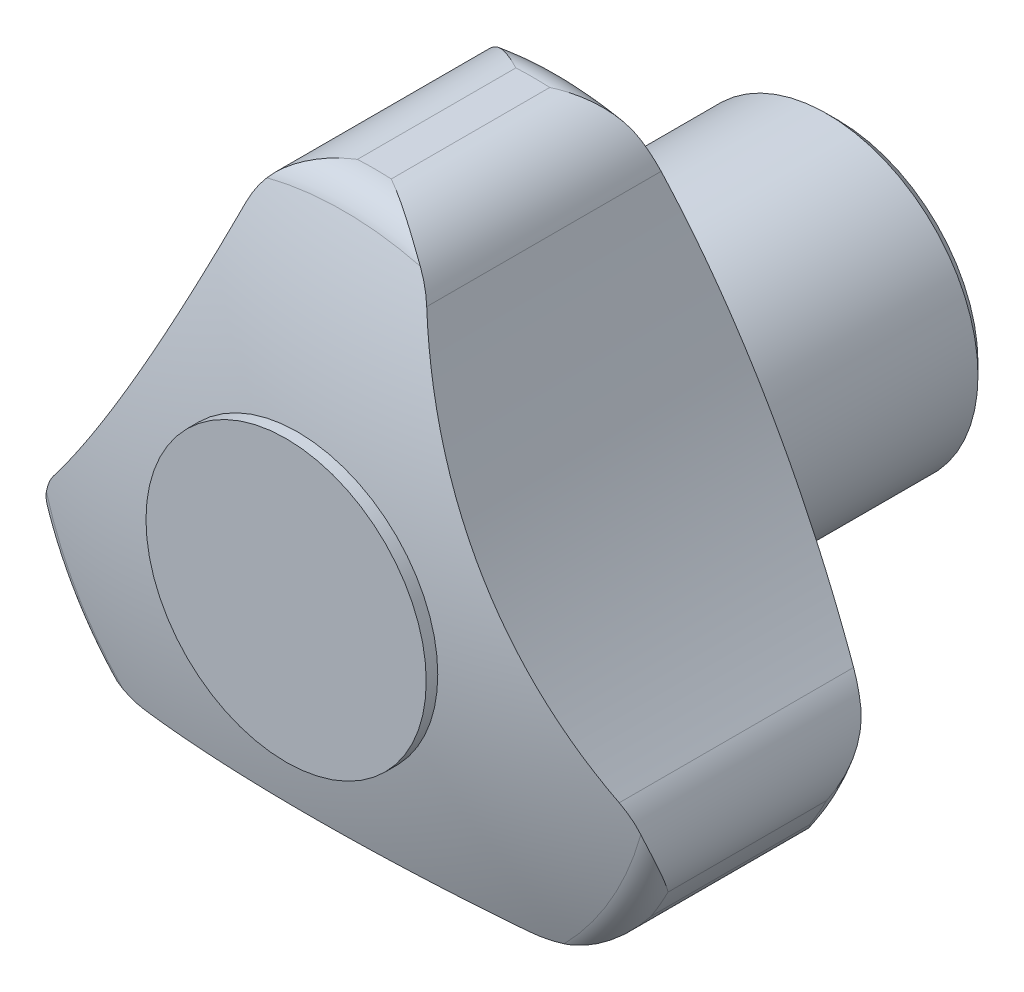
ISO-10303-21;
HEADER;
FILE_DESCRIPTION(('STEP AP214'),'2;1');
FILE_NAME('part.step','',(''),(''),'','','');
FILE_SCHEMA(('AUTOMOTIVE_DESIGN { 1 0 10303 214 1 1 1 1 }'));
ENDSEC;
DATA;
#1=APPLICATION_CONTEXT('core data for automotive mechanical design processes');
#2=APPLICATION_PROTOCOL_DEFINITION('international standard','automotive_design',2000,#1);
#3=PRODUCT_CONTEXT('',#1,'mechanical');
#4=PRODUCT('Part','Part','',(#3));
#5=PRODUCT_RELATED_PRODUCT_CATEGORY('part','',(#4));
#6=PRODUCT_DEFINITION_FORMATION('','',#4);
#7=PRODUCT_DEFINITION_CONTEXT('part definition',#1,'design');
#8=PRODUCT_DEFINITION('design','',#6,#7);
#9=PRODUCT_DEFINITION_SHAPE('','',#8);
#10=(LENGTH_UNIT() NAMED_UNIT(*) SI_UNIT(.MILLI.,.METRE.));
#11=(NAMED_UNIT(*) PLANE_ANGLE_UNIT() SI_UNIT($,.RADIAN.));
#12=(NAMED_UNIT(*) SI_UNIT($,.STERADIAN.) SOLID_ANGLE_UNIT());
#13=UNCERTAINTY_MEASURE_WITH_UNIT(LENGTH_MEASURE(1.E-05),#10,'distance_accuracy_value','');
#14=(GEOMETRIC_REPRESENTATION_CONTEXT(3) GLOBAL_UNCERTAINTY_ASSIGNED_CONTEXT((#13)) GLOBAL_UNIT_ASSIGNED_CONTEXT((#10,
#11,#12)) REPRESENTATION_CONTEXT('',''));
#15=CARTESIAN_POINT('',(0.,0.,0.));
#16=DIRECTION('',(0.,0.,1.));
#17=DIRECTION('',(1.,0.,0.));
#18=AXIS2_PLACEMENT_3D('',#15,#16,#17);
#19=CARTESIAN_POINT('',(0.,0.,-27.5));
#20=DIRECTION('',(0.,0.,1.));
#21=DIRECTION('',(0.,-1.,0.));
#22=AXIS2_PLACEMENT_3D('',#19,#20,#21);
#23=SPHERICAL_SURFACE('',#22,78.);
#24=CARTESIAN_POINT('',(6.97742327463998,27.1998358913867,45.2700796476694));
#25=CARTESIAN_POINT('',(7.11374007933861,27.0320995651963,45.319707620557));
#26=CARTESIAN_POINT('',(7.24250290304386,26.8587846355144,45.3711266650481));
#27=CARTESIAN_POINT('',(7.48341316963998,26.5036279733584,45.4767403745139));
#28=CARTESIAN_POINT('',(7.59567005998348,26.3218540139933,45.5309132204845));
#29=CARTESIAN_POINT('',(7.80397339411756,25.9500413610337,45.6419294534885));
#30=CARTESIAN_POINT('',(7.90002040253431,25.7600029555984,45.6987727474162));
#31=CARTESIAN_POINT('',(8.07604463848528,25.3716747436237,45.8151067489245));
#32=CARTESIAN_POINT('',(8.15590447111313,25.1733364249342,45.8746132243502));
#33=CARTESIAN_POINT('',(8.22705995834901,24.9722047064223,45.93503575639));
#34=B_SPLINE_CURVE_WITH_KNOTS('',3,(#24,#25,#26,#27,#28,#29,#30,#31,#32,#33),.UNSPECIFIED.,.F.,
.F.,(4,2,2,2,4),(0.,0.665063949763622,1.32549717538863,1.98590739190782,2.65094806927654),.UNSPECIFIED.);
#35=CARTESIAN_POINT('',(6.97797246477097,27.199159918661,45.2702796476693));
#36=VERTEX_POINT('',#35);
#37=CARTESIAN_POINT('',(8.22698918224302,24.9724047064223,45.9349756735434));
#38=VERTEX_POINT('',#37);
#39=EDGE_CURVE('E332',#36,#38,#34,.T.);
#40=ORIENTED_EDGE('',*,*,#39,.F.);
#41=CARTESIAN_POINT('',(0.,0.,45.2702796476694));
#42=DIRECTION('',(0.,0.,1.));
#43=DIRECTION('',(1.,0.,0.));
#44=AXIS2_PLACEMENT_3D('',#41,#42,#43);
#45=CIRCLE('',#44,28.08);
#46=CARTESIAN_POINT('',(-6.97797246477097,27.199159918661,45.2702796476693));
#47=VERTEX_POINT('',#46);
#48=EDGE_CURVE('E172',#36,#47,#45,.T.);
#49=ORIENTED_EDGE('',*,*,#48,.T.);
#50=CARTESIAN_POINT('',(-8.22705995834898,24.9722047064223,45.9350357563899));
#51=CARTESIAN_POINT('',(-8.1559044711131,25.1733364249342,45.8746132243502));
#52=CARTESIAN_POINT('',(-8.07604463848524,25.3716747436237,45.8151067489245));
#53=CARTESIAN_POINT('',(-7.90002040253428,25.7600029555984,45.6987727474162));
#54=CARTESIAN_POINT('',(-7.80397339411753,25.9500413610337,45.6419294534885));
#55=CARTESIAN_POINT('',(-7.59567005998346,26.3218540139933,45.5309132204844));
#56=CARTESIAN_POINT('',(-7.48341316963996,26.5036279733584,45.4767403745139));
#57=CARTESIAN_POINT('',(-7.24250290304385,26.8587846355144,45.3711266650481));
#58=CARTESIAN_POINT('',(-7.11374007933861,27.0320995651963,45.319707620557));
#59=CARTESIAN_POINT('',(-6.97742327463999,27.1998358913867,45.2700796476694));
#60=B_SPLINE_CURVE_WITH_KNOTS('',3,(#50,#51,#52,#53,#54,#55,#56,#57,#58,#59),.UNSPECIFIED.,.F.,
.F.,(4,2,2,2,4),(0.,0.665040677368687,1.32545089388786,1.98588411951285,2.65094806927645),.UNSPECIFIED.);
#61=CARTESIAN_POINT('',(-8.22698918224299,24.9724047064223,45.9349756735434));
#62=VERTEX_POINT('',#61);
#63=EDGE_CURVE('E323',#62,#47,#60,.T.);
#64=ORIENTED_EDGE('',*,*,#63,.F.);
#65=CARTESIAN_POINT('',(-8.22691840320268,24.9726047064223,45.9349155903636));
#66=CARTESIAN_POINT('',(-8.47401686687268,24.2743319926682,46.1446978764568));
#67=CARTESIAN_POINT('',(-8.73045243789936,23.5754609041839,46.341517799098));
#68=CARTESIAN_POINT('',(-9.26195272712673,22.1778497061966,46.7088382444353));
#69=CARTESIAN_POINT('',(-9.5370182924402,21.4791096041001,46.8793375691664));
#70=CARTESIAN_POINT('',(-10.1057605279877,20.0830303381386,47.193630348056));
#71=CARTESIAN_POINT('',(-10.399440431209,19.3856914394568,47.337419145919));
#72=CARTESIAN_POINT('',(-11.0051328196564,17.9939943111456,47.5979113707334));
#73=CARTESIAN_POINT('',(-11.3171449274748,17.2996360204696,47.7146153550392));
#74=CARTESIAN_POINT('',(-12.2626847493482,15.2610439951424,48.0180019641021));
#75=CARTESIAN_POINT('',(-12.9214882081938,13.9225643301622,48.1666386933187));
#76=CARTESIAN_POINT('',(-14.3040619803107,11.2723363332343,48.358891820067));
#77=CARTESIAN_POINT('',(-15.0278208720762,9.96058335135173,48.4025266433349));
#78=CARTESIAN_POINT('',(-16.5042263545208,7.42689959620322,48.3848552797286));
#79=CARTESIAN_POINT('',(-17.254414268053,6.20350325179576,48.3278441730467));
#80=CARTESIAN_POINT('',(-18.8050317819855,3.79714542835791,48.1175366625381));
#81=CARTESIAN_POINT('',(-19.6054664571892,2.61418805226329,47.9642305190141));
#82=CARTESIAN_POINT('',(-20.8498565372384,0.859993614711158,47.6604127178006));
#83=CARTESIAN_POINT('',(-21.2778406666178,0.271075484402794,47.5448089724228));
#84=CARTESIAN_POINT('',(-22.1444418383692,-0.893473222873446,47.288825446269));
#85=CARTESIAN_POINT('',(-22.5830590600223,-1.46910357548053,47.1484452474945));
#86=CARTESIAN_POINT('',(-23.4698668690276,-2.60620177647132,46.8432320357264));
#87=CARTESIAN_POINT('',(-23.9180563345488,-3.16767126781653,46.6784018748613));
#88=CARTESIAN_POINT('',(-24.8230309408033,-4.27586060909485,46.3246394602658));
#89=CARTESIAN_POINT('',(-25.2798157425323,-4.82258103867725,46.1357081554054));
#90=CARTESIAN_POINT('',(-25.7404023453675,-5.36162072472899,45.9349011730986));
#91=B_SPLINE_CURVE_WITH_KNOTS('',3,(#65,#66,#67,#68,#69,#70,#71,#72,#73,#74,#75,#76,#77,#78,#79,
#80,#81,#82,#83,#84,#85,#86,#87,#88,#89,#90),.UNSPECIFIED.,.F.,.F.,(4,2,2,2,2,2,2,2,2,2,2,2,4),
(0.,2.30935724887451,4.61881957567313,6.92868412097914,9.23850112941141,13.7304222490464,
18.22155506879,22.5256330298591,26.8301463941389,29.0410261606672,31.2519432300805,
33.4626025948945,35.6731749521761),.UNSPECIFIED.);
#92=CARTESIAN_POINT('',(-25.7402314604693,-5.36142072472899,45.9349756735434));
#93=VERTEX_POINT('',#92);
#94=EDGE_CURVE('E331',#62,#93,#91,.T.);
#95=ORIENTED_EDGE('',*,*,#94,.T.);
#96=CARTESIAN_POINT('',(-27.0444604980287,-7.55729213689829,45.2700796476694));
#97=CARTESIAN_POINT('',(-26.9673534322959,-7.35536609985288,45.3197086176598));
#98=CARTESIAN_POINT('',(-26.8816378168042,-7.15719285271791,45.3711287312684));
#99=CARTESIAN_POINT('',(-26.6945138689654,-6.77097275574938,45.4767446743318));
#100=CARTESIAN_POINT('',(-26.5932189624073,-6.58286500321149,45.5309186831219));
#101=CARTESIAN_POINT('',(-26.3753658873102,-6.21655623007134,45.6419373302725));
#102=CARTESIAN_POINT('',(-26.2588082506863,-6.03835486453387,45.698781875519));
#103=CARTESIAN_POINT('',(-26.0105115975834,-5.69174370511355,45.8151184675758));
#104=CARTESIAN_POINT('',(-25.8786718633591,-5.52341132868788,45.8746262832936));
#105=CARTESIAN_POINT('',(-25.740060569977,-5.36122072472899,45.9350501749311));
#106=B_SPLINE_CURVE_WITH_KNOTS('',3,(#96,#97,#98,#99,#100,#101,#102,#103,#104,#105),
.UNSPECIFIED.,.F.,.F.,(4,2,2,2,4),(0.,0.665077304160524,1.3255236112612,1.98594690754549,
2.6510009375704),.UNSPECIFIED.);
#107=CARTESIAN_POINT('',(-27.0441496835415,-7.55647853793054,45.2702796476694));
#108=VERTEX_POINT('',#107);
#109=EDGE_CURVE('E22',#108,#93,#106,.T.);
#110=ORIENTED_EDGE('',*,*,#109,.F.);
#111=CARTESIAN_POINT('',(-20.0661772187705,-19.6426813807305,45.2702796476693));
#112=VERTEX_POINT('',#111);
#113=EDGE_CURVE('E680',#108,#112,#45,.T.);
#114=ORIENTED_EDGE('',*,*,#113,.T.);
#115=CARTESIAN_POINT('',(-17.1413725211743,-19.5321886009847,46.0436398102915));
#116=CARTESIAN_POINT('',(-17.2029009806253,-19.5468639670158,46.0254012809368));
#117=CARTESIAN_POINT('',(-17.2646283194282,-19.5607648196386,46.0072337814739));
#118=CARTESIAN_POINT('',(-17.3885257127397,-19.5870224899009,45.9710287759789));
#119=CARTESIAN_POINT('',(-17.450696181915,-19.5993775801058,45.9529914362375));
#120=CARTESIAN_POINT('',(-17.7217766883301,-19.6496807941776,45.874909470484));
#121=CARTESIAN_POINT('',(-17.9324797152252,-19.6796066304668,45.8156732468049));
#122=CARTESIAN_POINT('',(-18.3563742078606,-19.7214719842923,45.6994252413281));
#123=CARTESIAN_POINT('',(-18.5695670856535,-19.7334007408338,45.642414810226));
#124=CARTESIAN_POINT('',(-18.9972332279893,-19.7390012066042,45.530992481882));
#125=CARTESIAN_POINT('',(-19.2117079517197,-19.7326449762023,45.4765846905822));
#126=CARTESIAN_POINT('',(-19.6401572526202,-19.7014609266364,45.3708831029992));
#127=CARTESIAN_POINT('',(-19.854131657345,-19.676627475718,45.3195902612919));
#128=CARTESIAN_POINT('',(-20.2697748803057,-19.6100877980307,45.2229335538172));
#129=CARTESIAN_POINT('',(-20.4715433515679,-19.569244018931,45.1774035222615));
#130=CARTESIAN_POINT('',(-20.8717619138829,-19.4708708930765,45.0899380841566));
#131=CARTESIAN_POINT('',(-21.0702121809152,-19.4133424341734,45.0480024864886));
#132=CARTESIAN_POINT('',(-21.4622020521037,-19.281875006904,44.9681134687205));
#133=CARTESIAN_POINT('',(-21.6557462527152,-19.2079520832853,44.9301562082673));
#134=CARTESIAN_POINT('',(-22.0366403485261,-19.0440313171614,44.8585212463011));
#135=CARTESIAN_POINT('',(-22.2239928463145,-18.9540403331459,44.8248417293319));
#136=CARTESIAN_POINT('',(-22.5587642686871,-18.7757122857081,44.7675916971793));
#137=CARTESIAN_POINT('',(-22.7073991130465,-18.6898820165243,44.7432858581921));
#138=CARTESIAN_POINT('',(-22.9987680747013,-18.5079902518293,44.6979291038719));
#139=CARTESIAN_POINT('',(-23.1415030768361,-18.4119302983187,44.6768776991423));
#140=CARTESIAN_POINT('',(-23.420463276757,-18.2098786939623,44.6381471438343));
#141=CARTESIAN_POINT('',(-23.5566818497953,-18.1038772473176,44.6204713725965));
#142=CARTESIAN_POINT('',(-23.8217596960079,-17.8824917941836,44.588628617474));
#143=CARTESIAN_POINT('',(-23.9506171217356,-17.7671054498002,44.5744625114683));
#144=CARTESIAN_POINT('',(-24.0754109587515,-17.6472874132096,44.5621109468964));
#145=B_SPLINE_CURVE_WITH_KNOTS('',3,(#115,#116,#117,#118,#119,#120,#121,#122,#123,#124,#125,
#126,#127,#128,#129,#130,#131,#132,#133,#134,#135,#136,#137,#138,#139,#140,#141,#142,#143,#144),
.UNSPECIFIED.,.F.,.F.,(4,2,2,2,2,2,2,2,2,2,2,2,2,2,4),(0.,0.197476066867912,0.395170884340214,
1.05705211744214,1.71932895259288,2.38261829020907,3.04610987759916,3.67791454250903,
4.30968559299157,4.94084105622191,5.57172775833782,6.09136169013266,6.61091740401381,
7.1309905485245,7.65119364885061),.UNSPECIFIED.);
#146=CARTESIAN_POINT('',(-17.5132422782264,-19.6109839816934,45.9349756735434));
#147=VERTEX_POINT('',#146);
#148=EDGE_CURVE('E144',#147,#112,#145,.T.);
#149=ORIENTED_EDGE('',*,*,#148,.F.);
#150=CARTESIAN_POINT('',(-17.5134422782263,-19.6110210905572,45.9349180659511));
#151=CARTESIAN_POINT('',(-16.7851711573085,-19.4758783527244,46.1447002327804));
#152=CARTESIAN_POINT('',(-16.0517132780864,-19.3485225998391,46.3415200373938));
#153=CARTESIAN_POINT('',(-14.5755963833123,-19.1100098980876,46.7088402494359));
#154=CARTESIAN_POINT('',(-13.8329369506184,-18.9988536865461,46.8793394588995));
#155=CARTESIAN_POINT('',(-12.3395257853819,-18.7933594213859,47.1936320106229));
#156=CARTESIAN_POINT('',(-11.5887726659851,-18.6990243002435,47.3374206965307));
#157=CARTESIAN_POINT('',(-10.0806814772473,-18.5277208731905,47.5979127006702));
#158=CARTESIAN_POINT('',(-9.32334354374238,-18.450752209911,47.7146165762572));
#159=CARTESIAN_POINT('',(-7.08510119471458,-18.2503179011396,48.0180028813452));
#160=CARTESIAN_POINT('',(-5.59654208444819,-18.1516187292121,48.1666394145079));
#161=CARTESIAN_POINT('',(-2.6100904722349,-18.0238489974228,48.3588921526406));
#162=CARTESIAN_POINT('',(-1.11219965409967,-17.9947662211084,48.4025267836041));
#163=CARTESIAN_POINT('',(1.82023189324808,-18.006529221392,48.3848550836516));
#164=CARTESIAN_POINT('',(3.25481251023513,-18.0445126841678,48.3278442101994));
#165=CARTESIAN_POINT('',(6.11407705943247,-18.1842071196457,48.1175379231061));
#166=CARTESIAN_POINT('',(7.53875997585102,-18.2859245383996,47.9642327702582));
#167=CARTESIAN_POINT('',(9.68012359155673,-18.4864993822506,47.6604170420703));
#168=CARTESIAN_POINT('',(10.4041308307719,-18.5626849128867,47.5448141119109));
#169=CARTESIAN_POINT('',(11.8459544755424,-18.7309080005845,47.288832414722));
#170=CARTESIAN_POINT('',(12.5637707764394,-18.8229458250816,47.148453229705));
#171=CARTESIAN_POINT('',(13.9919250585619,-19.0223933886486,46.843242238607));
#172=CARTESIAN_POINT('',(14.7022639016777,-19.1298013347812,46.6784132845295));
#173=CARTESIAN_POINT('',(16.1144659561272,-19.3594360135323,46.3246534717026));
#174=CARTESIAN_POINT('',(16.8163294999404,-19.4816621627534,46.1357235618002));
#175=CARTESIAN_POINT('',(17.5134422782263,-19.6110210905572,45.9349180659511));
#176=B_SPLINE_CURVE_WITH_KNOTS('',3,(#150,#151,#152,#153,#154,#155,#156,#157,#158,#159,#160,
#161,#162,#163,#164,#165,#166,#167,#168,#169,#170,#171,#172,#173,#174,#175),.UNSPECIFIED.,.F.,
.F.,(4,2,2,2,2,2,2,2,2,2,2,2,4),(0.,2.30935705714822,4.61881919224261,6.92868355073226,
9.23850037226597,13.7304213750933,18.2215540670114,22.52561510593,26.8301115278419,
29.0409822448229,31.2518902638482,33.4625405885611,35.673103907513),.UNSPECIFIED.);
#177=CARTESIAN_POINT('',(17.5132422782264,-19.6109839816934,45.9349756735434));
#178=VERTEX_POINT('',#177);
#179=EDGE_CURVE('E206',#147,#178,#176,.T.);
#180=ORIENTED_EDGE('',*,*,#179,.T.);
#181=CARTESIAN_POINT('',(24.0754104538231,-17.6472878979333,44.5621109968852));
#182=CARTESIAN_POINT('',(23.9280882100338,-17.7887501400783,44.5766897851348));
#183=CARTESIAN_POINT('',(23.7750945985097,-17.924023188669,44.5938019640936));
#184=CARTESIAN_POINT('',(23.4590041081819,-18.1813822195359,44.6328932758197));
#185=CARTESIAN_POINT('',(23.2959085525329,-18.3034699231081,44.6548717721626));
#186=CARTESIAN_POINT('',(22.9614218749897,-18.5332696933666,44.7034116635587));
#187=CARTESIAN_POINT('',(22.7900629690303,-18.6410322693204,44.7299561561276));
#188=CARTESIAN_POINT('',(22.4397723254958,-18.8420833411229,44.7874408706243));
#189=CARTESIAN_POINT('',(22.26084108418,-18.9353727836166,44.8183808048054));
#190=CARTESIAN_POINT('',(21.9186464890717,-19.0966430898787,44.8804071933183));
#191=CARTESIAN_POINT('',(21.7560938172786,-19.1663191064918,44.9110265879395));
#192=CARTESIAN_POINT('',(21.4269601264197,-19.2938672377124,44.9752664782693));
#193=CARTESIAN_POINT('',(21.2603783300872,-19.351737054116,45.0088875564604));
#194=CARTESIAN_POINT('',(20.9239238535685,-19.4555250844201,45.0789515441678));
#195=CARTESIAN_POINT('',(20.7540480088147,-19.5014311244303,45.1153972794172));
#196=CARTESIAN_POINT('',(20.4120323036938,-19.5811051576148,45.1908627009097));
#197=CARTESIAN_POINT('',(20.2398922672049,-19.6148722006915,45.2298825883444));
#198=CARTESIAN_POINT('',(19.8541981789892,-19.6766161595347,45.3195748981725));
#199=CARTESIAN_POINT('',(19.6402750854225,-19.7014469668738,45.3708549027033));
#200=CARTESIAN_POINT('',(19.2119158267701,-19.7326352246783,45.4765325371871));
#201=CARTESIAN_POINT('',(18.997479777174,-19.7389965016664,45.530929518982));
#202=CARTESIAN_POINT('',(18.5698015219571,-19.7334117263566,45.6423524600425));
#203=CARTESIAN_POINT('',(18.3565582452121,-19.7214862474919,45.6993753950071));
#204=CARTESIAN_POINT('',(17.9325685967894,-19.6796193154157,45.8156482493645));
#205=CARTESIAN_POINT('',(17.7218207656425,-19.6496889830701,45.87489677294));
#206=CARTESIAN_POINT('',(17.4506931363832,-19.5993770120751,45.9529923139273));
#207=CARTESIAN_POINT('',(17.3885196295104,-19.5870212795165,45.971030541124));
#208=CARTESIAN_POINT('',(17.264622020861,-19.5607634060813,46.0072356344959));
#209=CARTESIAN_POINT('',(17.2028974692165,-19.5468631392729,46.0254023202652));
#210=CARTESIAN_POINT('',(17.1413717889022,-19.5321884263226,46.0436400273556));
#211=B_SPLINE_CURVE_WITH_KNOTS('',3,(#181,#182,#183,#184,#185,#186,#187,#188,#189,#190,#191,
#192,#193,#194,#195,#196,#197,#198,#199,#200,#201,#202,#203,#204,#205,#206,#207,#208,#209,#210),
.UNSPECIFIED.,.F.,.F.,(4,2,2,2,2,2,2,2,2,2,2,2,2,2,4),(0.,0.61408279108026,1.22808531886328,
1.83986200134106,2.4515986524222,2.98960909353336,3.52772416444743,4.06638468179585,
4.60508734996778,5.26840013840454,5.93157549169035,6.59400528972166,7.25602635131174,
7.45373084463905,7.65119801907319),.UNSPECIFIED.);
#212=CARTESIAN_POINT('',(20.0661772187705,-19.6426813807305,45.2702796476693));
#213=VERTEX_POINT('',#212);
#214=EDGE_CURVE('E468',#213,#178,#211,.T.);
#215=ORIENTED_EDGE('',*,*,#214,.F.);
#216=CARTESIAN_POINT('',(27.0441496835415,-7.55647853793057,45.2702796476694));
#217=VERTEX_POINT('',#216);
#218=EDGE_CURVE('E503',#213,#217,#45,.T.);
#219=ORIENTED_EDGE('',*,*,#218,.T.);
#220=CARTESIAN_POINT('',(25.7400605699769,-5.36122072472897,45.9350501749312));
#221=CARTESIAN_POINT('',(25.8786718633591,-5.52341132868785,45.8746262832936));
#222=CARTESIAN_POINT('',(26.0105115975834,-5.69174370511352,45.8151184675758));
#223=CARTESIAN_POINT('',(26.2588082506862,-6.03835486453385,45.698781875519));
#224=CARTESIAN_POINT('',(26.3753658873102,-6.21655623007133,45.6419373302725));
#225=CARTESIAN_POINT('',(26.5932189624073,-6.5828650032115,45.5309186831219));
#226=CARTESIAN_POINT('',(26.6945138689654,-6.77097275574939,45.4767446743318));
#227=CARTESIAN_POINT('',(26.8816378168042,-7.15719285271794,45.3711287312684));
#228=CARTESIAN_POINT('',(26.9673534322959,-7.35536609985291,45.3197086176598));
#229=CARTESIAN_POINT('',(27.0444604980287,-7.55729213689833,45.2700796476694));
#230=B_SPLINE_CURVE_WITH_KNOTS('',3,(#220,#221,#222,#223,#224,#225,#226,#227,#228,#229),
.UNSPECIFIED.,.F.,.F.,(4,2,2,2,4),(0.,0.665054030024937,1.32547732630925,1.98592363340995,
2.6510009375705),.UNSPECIFIED.);
#231=CARTESIAN_POINT('',(25.7402314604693,-5.36142072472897,45.9349756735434));
#232=VERTEX_POINT('',#231);
#233=EDGE_CURVE('E425',#232,#217,#230,.T.);
#234=ORIENTED_EDGE('',*,*,#233,.F.);
#235=CARTESIAN_POINT('',(25.7404023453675,-5.36162072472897,45.9349011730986));
#236=CARTESIAN_POINT('',(25.2592294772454,-4.79849120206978,46.144684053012));
#237=CARTESIAN_POINT('',(24.7822069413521,-4.22697631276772,46.3415045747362));
#238=CARTESIAN_POINT('',(23.8375898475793,-3.06787869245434,46.7088262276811));
#239=CARTESIAN_POINT('',(23.3699957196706,-2.48029523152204,46.8793261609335));
#240=CARTESIAN_POINT('',(22.4453262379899,-1.28971106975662,47.1936201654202));
#241=CARTESIAN_POINT('',(21.9882527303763,-0.686707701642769,47.3374095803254));
#242=CARTESIAN_POINT('',(21.0858533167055,0.533685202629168,47.5979030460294));
#243=CARTESIAN_POINT('',(20.6405271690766,1.15107444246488,47.7146076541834));
#244=CARTESIAN_POINT('',(19.3478237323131,2.98923106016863,48.0179961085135));
#245=CARTESIAN_POINT('',(18.5180674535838,4.22901087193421,48.1666340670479));
#246=CARTESIAN_POINT('',(16.9141882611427,6.75146787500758,48.3588896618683));
#247=CARTESIAN_POINT('',(16.1400556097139,8.0341374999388,48.4025257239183));
#248=CARTESIAN_POINT('',(14.6840224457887,10.5795832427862,48.3848567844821));
#249=CARTESIAN_POINT('',(13.9996233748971,11.8409628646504,48.3278468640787));
#250=CARTESIAN_POINT('',(12.6909636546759,14.3870153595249,48.1175417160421));
#251=CARTESIAN_POINT('',(12.0667090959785,15.6716905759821,47.9642367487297));
#252=CARTESIAN_POINT('',(11.1697260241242,17.6264609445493,47.660420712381));
#253=CARTESIAN_POINT('',(10.8736996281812,18.2915650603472,47.5448175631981));
#254=CARTESIAN_POINT('',(10.2984706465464,19.624337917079,47.2888352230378));
#255=CARTESIAN_POINT('',(10.0192683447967,20.292006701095,47.1484556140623));
#256=CARTESIAN_POINT('',(9.47791550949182,21.6285538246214,46.8432435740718));
#257=CARTESIAN_POINT('',(9.21576299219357,22.2974320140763,46.6784139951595));
#258=CARTESIAN_POINT('',(8.70852935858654,23.6352576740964,46.3246527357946));
#259=CARTESIAN_POINT('',(8.46344757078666,24.3042051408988,46.1357220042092));
#260=CARTESIAN_POINT('',(8.22691840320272,24.9726047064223,45.9349155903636));
#261=B_SPLINE_CURVE_WITH_KNOTS('',3,(#235,#236,#237,#238,#239,#240,#241,#242,#243,#244,#245,
#246,#247,#248,#249,#250,#251,#252,#253,#254,#255,#256,#257,#258,#259,#260),.UNSPECIFIED.,.F.,
.F.,(4,2,2,2,2,2,2,2,2,2,2,2,4),(0.,2.30935725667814,4.61881959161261,6.92868414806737,
9.23850116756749,13.7304223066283,18.2215551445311,22.5256330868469,26.8301464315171,
29.0410261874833,31.2519432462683,33.4626026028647,35.6731749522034),.UNSPECIFIED.);
#262=EDGE_CURVE('E499',#232,#38,#261,.T.);
#263=ORIENTED_EDGE('',*,*,#262,.T.);
#264=EDGE_LOOP('',(#40,#49,#64,#95,#110,#114,#149,#180,#215,#219,#234,#263));
#265=FACE_BOUND('',#264,.T.);
#266=CARTESIAN_POINT('',(0.,0.,49.4508771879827));
#267=DIRECTION('',(0.,0.,-1.));
#268=DIRECTION('',(-1.,0.,0.));
#269=AXIS2_PLACEMENT_3D('',#266,#267,#268);
#270=CIRCLE('',#269,12.75);
#271=CARTESIAN_POINT('',(-12.75,0.,49.4508771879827));
#272=VERTEX_POINT('',#271);
#273=EDGE_CURVE('E9',#272,#272,#270,.T.);
#274=ORIENTED_EDGE('',*,*,#273,.T.);
#275=EDGE_LOOP('',(#274));
#276=FACE_BOUND('',#275,.T.);
#277=ADVANCED_FACE('F14',(#265,#276),#23,.T.);
#278=CARTESIAN_POINT('',(0.,0.,28.0527665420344));
#279=DIRECTION('',(0.,0.,1.));
#280=DIRECTION('',(1.,0.,0.));
#281=AXIS2_PLACEMENT_3D('',#278,#279,#280);
#282=TOROIDAL_SURFACE('',#281,27.,3.);
#283=CARTESIAN_POINT('',(-27.0262930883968,-7.51020413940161,25.2426585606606));
#284=CARTESIAN_POINT('',(-27.0933608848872,-7.68228966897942,25.2840828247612));
#285=CARTESIAN_POINT('',(-27.1535680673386,-7.85559725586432,25.3309487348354));
#286=CARTESIAN_POINT('',(-27.2604817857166,-8.20340138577,25.4338325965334));
#287=CARTESIAN_POINT('',(-27.3072061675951,-8.37789604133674,25.4898382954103));
#288=CARTESIAN_POINT('',(-27.387387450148,-8.72656818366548,25.6091451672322));
#289=CARTESIAN_POINT('',(-27.4208978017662,-8.900744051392,25.6724155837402));
#290=CARTESIAN_POINT('',(-27.4753152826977,-9.24872718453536,25.8051772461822));
#291=CARTESIAN_POINT('',(-27.4962165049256,-9.42253423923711,25.8746713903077));
#292=CARTESIAN_POINT('',(-27.5493482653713,-10.0454049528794,26.1336492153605));
#293=CARTESIAN_POINT('',(-27.5465568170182,-10.4917417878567,26.3378701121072));
#294=CARTESIAN_POINT('',(-27.4649530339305,-11.3676971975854,26.7664464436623));
#295=CARTESIAN_POINT('',(-27.3860132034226,-11.797286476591,26.9908350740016));
#296=CARTESIAN_POINT('',(-27.2045910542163,-12.459830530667,27.3550760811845));
#297=CARTESIAN_POINT('',(-27.1250917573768,-12.7010841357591,27.4918000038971));
#298=CARTESIAN_POINT('',(-26.9426228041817,-13.1731522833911,27.7667593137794));
#299=CARTESIAN_POINT('',(-26.8396969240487,-13.4039853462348,27.9049914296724));
#300=CARTESIAN_POINT('',(-26.7228436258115,-13.6341246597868,28.0463614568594));
#301=CARTESIAN_POINT('',(-26.720190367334,-13.6393350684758,28.0495640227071));
#302=CARTESIAN_POINT('',(-26.7175310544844,-13.6445422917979,28.0527665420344));
#303=B_SPLINE_CURVE_WITH_KNOTS('',3,(#283,#284,#285,#286,#287,#288,#289,#290,#291,#292,#293,
#294,#295,#296,#297,#298,#299,#300,#301,#302),.UNSPECIFIED.,.F.,.F.,(4,2,2,2,2,2,2,2,2,4),(0.,
0.567449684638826,1.1341448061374,1.69852352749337,2.2631664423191,3.72758811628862,
5.19446594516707,6.0589138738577,6.92175951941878,6.9417595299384),.UNSPECIFIED.);
#304=CARTESIAN_POINT('',(-27.0266171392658,-7.51103584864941,25.2428585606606));
#305=VERTEX_POINT('',#304);
#306=CARTESIAN_POINT('',(-26.7175306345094,-13.6445431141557,28.0527665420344));
#307=VERTEX_POINT('',#306);
#308=EDGE_CURVE('E451',#305,#307,#303,.T.);
#309=ORIENTED_EDGE('',*,*,#308,.F.);
#310=CARTESIAN_POINT('',(0.,0.,25.2428585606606));
#311=DIRECTION('',(0.,0.,1.));
#312=DIRECTION('',(1.,0.,0.));
#313=AXIS2_PLACEMENT_3D('',#310,#311,#312);
#314=CIRCLE('',#313,28.0509125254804);
#315=CARTESIAN_POINT('',(-20.0180564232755,-19.650219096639,25.2428585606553));
#316=VERTEX_POINT('',#315);
#317=EDGE_CURVE('E184',#305,#316,#314,.T.);
#318=ORIENTED_EDGE('',*,*,#317,.T.);
#319=CARTESIAN_POINT('',(-25.1752857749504,-16.3157894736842,28.0527665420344));
#320=CARTESIAN_POINT('',(-25.1721059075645,-16.3206960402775,28.0495640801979));
#321=CARTESIAN_POINT('',(-25.1689201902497,-16.3255990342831,28.0463615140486));
#322=CARTESIAN_POINT('',(-24.9228869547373,-16.7032881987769,27.7994727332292));
#323=CARTESIAN_POINT('',(-24.6462215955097,-17.0553230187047,27.5552562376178));
#324=CARTESIAN_POINT('',(-24.1849676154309,-17.54471502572,27.1960685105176));
#325=CARTESIAN_POINT('',(-24.0231519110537,-17.7016659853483,27.0773078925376));
#326=CARTESIAN_POINT('',(-23.6845025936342,-18.0015519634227,26.843439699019));
#327=CARTESIAN_POINT('',(-23.5076736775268,-18.1444913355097,26.7283309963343));
#328=CARTESIAN_POINT('',(-23.1633360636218,-18.3976206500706,26.5177988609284));
#329=CARTESIAN_POINT('',(-22.997560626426,-18.5096574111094,26.4217496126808));
#330=CARTESIAN_POINT('',(-22.6554461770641,-18.7212469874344,26.2347058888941));
#331=CARTESIAN_POINT('',(-22.4791058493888,-18.8207982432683,26.1437120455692));
#332=CARTESIAN_POINT('',(-22.1169401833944,-19.0061068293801,25.9684404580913));
#333=CARTESIAN_POINT('',(-21.9311462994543,-19.0919064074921,25.88414256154));
#334=CARTESIAN_POINT('',(-21.5502561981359,-19.2489713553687,25.7236247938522));
#335=CARTESIAN_POINT('',(-21.3551652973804,-19.3202449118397,25.6474003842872));
#336=CARTESIAN_POINT('',(-20.9727036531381,-19.4419526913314,25.5108259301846));
#337=CARTESIAN_POINT('',(-20.7860080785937,-19.4936151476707,25.4496872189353));
#338=CARTESIAN_POINT('',(-20.4061609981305,-19.5828191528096,25.3377938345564));
#339=CARTESIAN_POINT('',(-20.2130079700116,-19.6203573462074,25.2870416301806));
#340=CARTESIAN_POINT('',(-19.7730239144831,-19.6877521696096,25.1873252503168));
#341=CARTESIAN_POINT('',(-19.5247068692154,-19.7134285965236,25.1418915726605));
#342=CARTESIAN_POINT('',(-19.0231350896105,-19.7397052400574,25.0765933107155));
#343=CARTESIAN_POINT('',(-18.769878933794,-19.7402981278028,25.0567362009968));
#344=CARTESIAN_POINT('',(-18.2990494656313,-19.7173656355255,25.0503477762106));
#345=CARTESIAN_POINT('',(-18.0814122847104,-19.6971832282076,25.0595655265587));
#346=CARTESIAN_POINT('',(-17.759659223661,-19.6532642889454,25.0954727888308));
#347=CARTESIAN_POINT('',(-17.6532931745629,-19.6363734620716,25.111096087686));
#348=CARTESIAN_POINT('',(-17.4428332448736,-19.5983461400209,25.1503116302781));
#349=CARTESIAN_POINT('',(-17.3387381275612,-19.5772120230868,25.173899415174));
#350=CARTESIAN_POINT('',(-17.1574048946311,-19.5364414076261,25.2231835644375));
#351=CARTESIAN_POINT('',(-17.0795140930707,-19.5175853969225,25.2471362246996));
#352=CARTESIAN_POINT('',(-16.9260254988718,-19.4778765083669,25.3003226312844));
#353=CARTESIAN_POINT('',(-16.8504291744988,-19.4570223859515,25.3295596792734));
#354=CARTESIAN_POINT('',(-16.7762303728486,-19.4353134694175,25.36153872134));
#355=B_SPLINE_CURVE_WITH_KNOTS('',3,(#319,#320,#321,#322,#323,#324,#325,#326,#327,#328,#329,
#330,#331,#332,#333,#334,#335,#336,#337,#338,#339,#340,#341,#342,#343,#344,#345,#346,#347,#348,
#349,#350,#351,#352,#353,#354),.UNSPECIFIED.,.F.,.F.,(4,2,2,2,2,2,2,2,2,2,2,2,2,2,2,2,2,4),(0.,
0.0200000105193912,1.54177517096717,2.305598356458,3.06918345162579,3.73441431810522,
4.39972819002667,5.06295719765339,5.72581137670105,6.3344090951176,6.94315130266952,
7.70208307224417,8.46123658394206,9.11480473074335,9.44095491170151,9.76692280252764,
10.0176433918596,10.2685211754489),.UNSPECIFIED.);
#356=CARTESIAN_POINT('',(-25.1752862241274,-16.3157887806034,28.0527665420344));
#357=VERTEX_POINT('',#356);
#358=EDGE_CURVE('E149',#357,#316,#355,.T.);
#359=ORIENTED_EDGE('',*,*,#358,.F.);
#360=CARTESIAN_POINT('',(0.,0.,28.0527665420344));
#361=DIRECTION('',(0.,0.,1.));
#362=DIRECTION('',(1.,0.,0.));
#363=AXIS2_PLACEMENT_3D('',#360,#361,#362);
#364=CIRCLE('',#363,30.);
#365=EDGE_CURVE('E159',#307,#357,#364,.T.);
#366=ORIENTED_EDGE('',*,*,#365,.F.);
#367=EDGE_LOOP('',(#309,#318,#359,#366));
#368=FACE_BOUND('',#367,.T.);
#369=ADVANCED_FACE('F253',(#368),#282,.T.);
#370=CARTESIAN_POINT('',(26.7175310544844,-13.6445422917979,28.0527665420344));
#371=CARTESIAN_POINT('',(26.7201903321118,-13.639335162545,28.0495640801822));
#372=CARTESIAN_POINT('',(26.722843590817,-13.6341247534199,28.04636151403));
#373=CARTESIAN_POINT('',(26.9269015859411,-13.2322363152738,27.7994894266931));
#374=CARTESIAN_POINT('',(27.0934309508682,-12.8166495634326,27.5552897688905));
#375=CARTESIAN_POINT('',(27.2866331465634,-12.1725137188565,27.196109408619));
#376=CARTESIAN_POINT('',(27.341654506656,-11.9538877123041,27.0773404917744));
#377=CARTESIAN_POINT('',(27.4320476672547,-11.5106363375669,26.8434557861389));
#378=CARTESIAN_POINT('',(27.4674255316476,-11.2860128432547,26.7283388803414));
#379=CARTESIAN_POINT('',(27.5144814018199,-10.8611681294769,26.5177696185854));
#380=CARTESIAN_POINT('',(27.5286222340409,-10.6615238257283,26.421692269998));
#381=CARTESIAN_POINT('',(27.5408010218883,-10.2593298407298,26.2345967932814));
#382=CARTESIAN_POINT('',(27.5388371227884,-10.0567798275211,26.1435792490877));
#383=CARTESIAN_POINT('',(27.5182165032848,-9.65048180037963,25.9683167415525));
#384=CARTESIAN_POINT('',(27.4996220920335,-9.44674107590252,25.8840477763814));
#385=CARTESIAN_POINT('',(27.4452070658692,-9.03847223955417,25.7235832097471));
#386=CARTESIAN_POINT('',(27.4093956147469,-8.83394460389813,25.6473833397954));
#387=CARTESIAN_POINT('',(27.3236036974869,-8.44204381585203,25.5108699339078));
#388=CARTESIAN_POINT('',(27.2750309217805,-8.25464336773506,25.4497652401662));
#389=CARTESIAN_POINT('',(27.1905784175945,-7.97458451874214,25.3658690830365));
#390=CARTESIAN_POINT('',(27.1604644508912,-7.88132543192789,25.3391775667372));
#391=CARTESIAN_POINT('',(27.0963226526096,-7.69532557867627,25.2886789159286));
#392=CARTESIAN_POINT('',(27.062293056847,-7.60258506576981,25.2648730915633));
#393=CARTESIAN_POINT('',(27.0262930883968,-7.51020413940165,25.2426585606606));
#394=B_SPLINE_CURVE_WITH_KNOTS('',3,(#370,#371,#372,#373,#374,#375,#376,#377,#378,#379,#380,
#381,#382,#383,#384,#385,#386,#387,#388,#389,#390,#391,#392,#393),.UNSPECIFIED.,.F.,.F.,(4,2,2,
2,2,2,2,2,2,2,2,4),(0.,0.0200000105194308,1.54167092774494,2.30554527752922,3.06918369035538,
3.73461285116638,4.40011864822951,5.06314140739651,5.72581166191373,6.3339765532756,
6.63858351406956,6.94332825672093),.UNSPECIFIED.);
#395=CARTESIAN_POINT('',(26.7175310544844,-13.6445422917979,28.0527665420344));
#396=VERTEX_POINT('',#395);
#397=CARTESIAN_POINT('',(27.0266171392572,-7.51103584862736,25.2428585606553));
#398=VERTEX_POINT('',#397);
#399=EDGE_CURVE('E272',#396,#398,#394,.T.);
#400=ORIENTED_EDGE('',*,*,#399,.F.);
#401=CARTESIAN_POINT('',(25.1752852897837,-16.315790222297,28.0527665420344));
#402=VERTEX_POINT('',#401);
#403=EDGE_CURVE('E170',#402,#396,#364,.T.);
#404=ORIENTED_EDGE('',*,*,#403,.F.);
#405=CARTESIAN_POINT('',(16.776230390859,-19.4353134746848,25.3615387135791));
#406=CARTESIAN_POINT('',(16.8652760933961,-19.4613763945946,25.323153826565));
#407=CARTESIAN_POINT('',(16.9563395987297,-19.4861946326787,25.2887265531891));
#408=CARTESIAN_POINT('',(17.1415963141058,-19.5328609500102,25.2274402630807));
#409=CARTESIAN_POINT('',(17.2357856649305,-19.5547125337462,25.2005722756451));
#410=CARTESIAN_POINT('',(17.426027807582,-19.5949072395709,25.1541087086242));
#411=CARTESIAN_POINT('',(17.5220659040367,-19.6132707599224,25.1344701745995));
#412=CARTESIAN_POINT('',(17.7158943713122,-19.6463707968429,25.1017668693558));
#413=CARTESIAN_POINT('',(17.8136853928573,-19.6611059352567,25.0887045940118));
#414=CARTESIAN_POINT('',(18.0375608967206,-19.6902870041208,25.0659065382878));
#415=CARTESIAN_POINT('',(18.163999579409,-19.7035288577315,25.0580861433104));
#416=CARTESIAN_POINT('',(18.4176777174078,-19.72357119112,25.0513373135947));
#417=CARTESIAN_POINT('',(18.5449176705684,-19.7303671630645,25.052415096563));
#418=CARTESIAN_POINT('',(18.7993769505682,-19.7374740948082,25.0624848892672));
#419=CARTESIAN_POINT('',(18.9265961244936,-19.7377784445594,25.0714849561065));
#420=CARTESIAN_POINT('',(19.1801970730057,-19.7319638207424,25.0964888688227));
#421=CARTESIAN_POINT('',(19.3065787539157,-19.7258441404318,25.1124934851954));
#422=CARTESIAN_POINT('',(19.5308074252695,-19.7093332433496,25.1465522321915));
#423=CARTESIAN_POINT('',(19.6289289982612,-19.7001481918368,25.1634195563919));
#424=CARTESIAN_POINT('',(19.8239642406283,-19.678032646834,25.2005637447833));
#425=CARTESIAN_POINT('',(19.9208792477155,-19.6651067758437,25.2208363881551));
#426=CARTESIAN_POINT('',(20.1986788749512,-19.6225476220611,25.2837908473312));
#427=CARTESIAN_POINT('',(20.3779804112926,-19.5882514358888,25.3304282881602));
#428=CARTESIAN_POINT('',(20.7312147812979,-19.5074196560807,25.432807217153));
#429=CARTESIAN_POINT('',(20.9051436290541,-19.4608752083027,25.4885552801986));
#430=CARTESIAN_POINT('',(21.2475094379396,-19.3561112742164,25.6077987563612));
#431=CARTESIAN_POINT('',(21.415922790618,-19.2978477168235,25.6713230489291));
#432=CARTESIAN_POINT('',(21.7459931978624,-19.1705117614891,25.8046161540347));
#433=CARTESIAN_POINT('',(21.9076509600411,-19.1014404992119,25.8743843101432));
#434=CARTESIAN_POINT('',(22.2703747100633,-18.9313423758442,26.040371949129));
#435=CARTESIAN_POINT('',(22.4690492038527,-18.8268915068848,26.1383364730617));
#436=CARTESIAN_POINT('',(22.8537585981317,-18.6024180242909,26.3409266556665));
#437=CARTESIAN_POINT('',(23.0397888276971,-18.4823897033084,26.4455547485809));
#438=CARTESIAN_POINT('',(23.5776614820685,-18.1010141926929,26.7667760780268));
#439=CARTESIAN_POINT('',(23.9100579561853,-17.8180072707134,26.9910703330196));
#440=CARTESIAN_POINT('',(24.3928326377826,-17.3299606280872,27.3550769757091));
#441=CARTESIAN_POINT('',(24.561955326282,-17.1405400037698,27.4917562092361));
#442=CARTESIAN_POINT('',(24.8795311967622,-16.7465010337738,27.766701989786));
#443=CARTESIAN_POINT('',(25.0280147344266,-16.5419057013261,27.9049658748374));
#444=CARTESIAN_POINT('',(25.1689201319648,-16.3255991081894,28.046361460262));
#445=CARTESIAN_POINT('',(25.1721058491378,-16.3206961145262,28.0495640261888));
#446=CARTESIAN_POINT('',(25.1752857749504,-16.3157894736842,28.0527665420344));
#447=B_SPLINE_CURVE_WITH_KNOTS('',3,(#405,#406,#407,#408,#409,#410,#411,#412,#413,#414,#415,
#416,#417,#418,#419,#420,#421,#422,#423,#424,#425,#426,#427,#428,#429,#430,#431,#432,#433,#434,
#435,#436,#437,#438,#439,#440,#441,#442,#443,#444,#445,#446),.UNSPECIFIED.,.F.,.F.,(4,2,2,2,2,2,
2,2,2,2,2,2,2,2,2,2,2,2,2,2,4),(0.,0.301052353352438,0.60174592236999,0.900622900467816,
1.19961322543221,1.58118845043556,1.96303032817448,2.34526099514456,2.72753371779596,
3.02734647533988,3.32679032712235,3.89120756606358,4.456033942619,5.02302552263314,
5.58995756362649,6.32361307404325,7.05753814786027,8.5226315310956,9.3869207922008,
10.2499251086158,10.2699251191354),.UNSPECIFIED.);
#448=CARTESIAN_POINT('',(20.0180564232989,-19.6502190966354,25.2428585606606));
#449=VERTEX_POINT('',#448);
#450=EDGE_CURVE('E263',#449,#402,#447,.T.);
#451=ORIENTED_EDGE('',*,*,#450,.F.);
#452=EDGE_CURVE('E179',#449,#398,#314,.T.);
#453=ORIENTED_EDGE('',*,*,#452,.T.);
#454=EDGE_LOOP('',(#400,#404,#451,#453));
#455=FACE_BOUND('',#454,.T.);
#456=ADVANCED_FACE('F254',(#455),#282,.T.);
#457=CARTESIAN_POINT('',(0.,0.,50.5));
#458=DIRECTION('',(0.,0.,1.));
#459=DIRECTION('',(1.,0.,0.));
#460=AXIS2_PLACEMENT_3D('',#457,#458,#459);
#461=CYLINDRICAL_SURFACE('',#460,30.);
#462=DIRECTION('',(0.,0.,-1.));
#463=VECTOR('',#462,1.);
#464=CARTESIAN_POINT('',(26.7175310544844,-13.6445422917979,50.5));
#465=LINE('',#464,#463);
#466=CARTESIAN_POINT('',(26.7175310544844,-13.6445422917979,42.4714227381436));
#467=VERTEX_POINT('',#466);
#468=EDGE_CURVE('E438',#467,#396,#465,.T.);
#469=ORIENTED_EDGE('',*,*,#468,.F.);
#470=CARTESIAN_POINT('',(0.,0.,42.4714227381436));
#471=DIRECTION('',(0.,0.,1.));
#472=DIRECTION('',(1.,0.,0.));
#473=AXIS2_PLACEMENT_3D('',#470,#471,#472);
#474=CIRCLE('',#473,30.);
#475=CARTESIAN_POINT('',(25.1752852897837,-16.315790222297,42.4714227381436));
#476=VERTEX_POINT('',#475);
#477=EDGE_CURVE('E167',#476,#467,#474,.T.);
#478=ORIENTED_EDGE('',*,*,#477,.F.);
#479=DIRECTION('',(0.,0.,-1.));
#480=VECTOR('',#479,1.);
#481=CARTESIAN_POINT('',(25.1752852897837,-16.315790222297,50.5));
#482=LINE('',#481,#480);
#483=EDGE_CURVE('E472',#476,#402,#482,.T.);
#484=ORIENTED_EDGE('',*,*,#483,.T.);
#485=ORIENTED_EDGE('',*,*,#403,.T.);
#486=EDGE_LOOP('',(#469,#478,#484,#485));
#487=FACE_BOUND('',#486,.T.);
#488=ADVANCED_FACE('F521',(#487),#461,.T.);
#489=CARTESIAN_POINT('',(-26.7175306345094,-13.6445431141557,42.4714227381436));
#490=VERTEX_POINT('',#489);
#491=CARTESIAN_POINT('',(-25.1752862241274,-16.3157887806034,42.4714227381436));
#492=VERTEX_POINT('',#491);
#493=EDGE_CURVE('E157',#490,#492,#474,.T.);
#494=ORIENTED_EDGE('',*,*,#493,.F.);
#495=DIRECTION('',(0.,0.,-1.));
#496=VECTOR('',#495,1.);
#497=CARTESIAN_POINT('',(-26.7175306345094,-13.6445431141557,50.5));
#498=LINE('',#497,#496);
#499=EDGE_CURVE('E161',#490,#307,#498,.T.);
#500=ORIENTED_EDGE('',*,*,#499,.T.);
#501=ORIENTED_EDGE('',*,*,#365,.T.);
#502=DIRECTION('',(0.,0.,-1.));
#503=VECTOR('',#502,1.);
#504=CARTESIAN_POINT('',(-25.1752862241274,-16.3157887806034,50.5));
#505=LINE('',#504,#503);
#506=EDGE_CURVE('E141',#492,#357,#505,.T.);
#507=ORIENTED_EDGE('',*,*,#506,.F.);
#508=EDGE_LOOP('',(#494,#500,#501,#507));
#509=FACE_BOUND('',#508,.T.);
#510=ADVANCED_FACE('F155',(#509),#461,.T.);
#511=CARTESIAN_POINT('',(0.,0.,42.4714227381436));
#512=DIRECTION('',(0.,0.,1.));
#513=DIRECTION('',(1.,0.,0.));
#514=AXIS2_PLACEMENT_3D('',#511,#512,#513);
#515=TOROIDAL_SURFACE('',#514,27.,3.);
#516=CARTESIAN_POINT('',(-26.7175310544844,-13.6445422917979,42.4714227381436));
#517=CARTESIAN_POINT('',(-26.7201903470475,-13.6393351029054,42.4746252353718));
#518=CARTESIAN_POINT('',(-26.7228436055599,-13.6341246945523,42.4778278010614));
#519=CARTESIAN_POINT('',(-26.9269125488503,-13.2322169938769,42.724711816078));
#520=CARTESIAN_POINT('',(-27.0933644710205,-12.8169449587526,42.9687239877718));
#521=CARTESIAN_POINT('',(-27.3511741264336,-11.9572601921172,43.4481194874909));
#522=CARTESIAN_POINT('',(-27.4423147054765,-11.5127671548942,43.6834760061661));
#523=CARTESIAN_POINT('',(-27.5144773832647,-10.8611866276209,44.0064045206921));
#524=CARTESIAN_POINT('',(-27.528615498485,-10.661617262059,44.1024505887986));
#525=CARTESIAN_POINT('',(-27.540798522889,-10.2595412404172,44.2894971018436));
#526=CARTESIAN_POINT('',(-27.5388413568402,-10.0570342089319,44.3804968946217));
#527=CARTESIAN_POINT('',(-27.5182376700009,-9.65072869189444,44.5557694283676));
#528=CARTESIAN_POINT('',(-27.499644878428,-9.44693645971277,44.640062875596));
#529=CARTESIAN_POINT('',(-27.4452222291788,-9.03856162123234,44.800572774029));
#530=CARTESIAN_POINT('',(-27.4094023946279,-8.83397954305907,44.8767938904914));
#531=CARTESIAN_POINT('',(-27.325263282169,-8.44962136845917,45.0106797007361));
#532=CARTESIAN_POINT('',(-27.2789488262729,-8.26980200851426,45.0694734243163));
#533=CARTESIAN_POINT('',(-27.1721172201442,-7.91145395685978,45.1775929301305));
#534=CARTESIAN_POINT('',(-27.1115957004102,-7.73292567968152,45.2269157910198));
#535=CARTESIAN_POINT('',(-26.9557720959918,-7.32527138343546,45.3271014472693));
#536=CARTESIAN_POINT('',(-26.8554823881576,-7.09701904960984,45.3739943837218));
#537=CARTESIAN_POINT('',(-26.6306713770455,-6.6485050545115,45.4426426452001));
#538=CARTESIAN_POINT('',(-26.5061444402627,-6.42824526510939,45.4643921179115));
#539=CARTESIAN_POINT('',(-26.2550091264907,-6.03257889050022,45.474746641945));
#540=CARTESIAN_POINT('',(-26.1314805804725,-5.85538185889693,45.4678108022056));
#541=CARTESIAN_POINT('',(-25.9366475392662,-5.59991843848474,45.4361811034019));
#542=CARTESIAN_POINT('',(-25.8701794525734,-5.51655879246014,45.4221231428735));
#543=CARTESIAN_POINT('',(-25.7346297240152,-5.35372415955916,45.3863430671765));
#544=CARTESIAN_POINT('',(-25.6655490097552,-5.27424781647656,45.3646236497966));
#545=CARTESIAN_POINT('',(-25.5126837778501,-5.10557556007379,45.3082011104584));
#546=CARTESIAN_POINT('',(-25.4285192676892,-5.01725771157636,45.271850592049));
#547=CARTESIAN_POINT('',(-25.301448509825,-4.89006591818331,45.2080587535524));
#548=CARTESIAN_POINT('',(-25.2588896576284,-4.84849098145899,45.1852091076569));
#549=CARTESIAN_POINT('',(-25.1737554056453,-4.76723743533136,45.1363470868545));
#550=CARTESIAN_POINT('',(-25.1311800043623,-4.72755929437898,45.1103339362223));
#551=CARTESIAN_POINT('',(-25.0887153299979,-4.68888035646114,45.0827061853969));
#552=B_SPLINE_CURVE_WITH_KNOTS('',3,(#516,#517,#518,#519,#520,#521,#522,#523,#524,#525,#526,
#527,#528,#529,#530,#531,#532,#533,#534,#535,#536,#537,#538,#539,#540,#541,#542,#543,#544,#545,
#546,#547,#548,#549,#550,#551),.UNSPECIFIED.,.F.,.F.,(4,2,2,2,2,2,2,2,2,2,2,2,2,2,2,2,2,4),(0.,
0.020000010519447,1.5417622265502,3.06789715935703,3.73315675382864,4.39850212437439,
5.06170630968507,5.72452509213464,6.30814891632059,6.891952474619,7.65074681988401,
8.40971774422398,9.05550377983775,9.37779732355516,9.69997749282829,10.0810360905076,
10.2721408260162,10.4632925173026),.UNSPECIFIED.);
#553=EDGE_CURVE('E165',#490,#108,#552,.T.);
#554=ORIENTED_EDGE('',*,*,#553,.F.);
#555=ORIENTED_EDGE('',*,*,#493,.T.);
#556=CARTESIAN_POINT('',(-16.7734646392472,-19.4345040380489,45.1614572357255));
#557=CARTESIAN_POINT('',(-16.8624136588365,-19.460575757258,45.199899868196));
#558=CARTESIAN_POINT('',(-16.9533825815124,-19.4854075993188,45.2343884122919));
#559=CARTESIAN_POINT('',(-17.1384551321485,-19.5321100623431,45.2958024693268));
#560=CARTESIAN_POINT('',(-17.2325548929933,-19.5539841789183,45.3227369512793));
#561=CARTESIAN_POINT('',(-17.4226143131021,-19.5942300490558,45.3693342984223));
#562=CARTESIAN_POINT('',(-17.5185589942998,-19.6126224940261,45.3890408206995));
#563=CARTESIAN_POINT('',(-17.7122063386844,-19.6457885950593,45.4218836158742));
#564=CARTESIAN_POINT('',(-17.8099096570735,-19.6605608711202,45.4350173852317));
#565=CARTESIAN_POINT('',(-18.0336773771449,-19.6898460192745,45.4579893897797));
#566=CARTESIAN_POINT('',(-18.1600991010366,-19.7031529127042,45.4659061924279));
#567=CARTESIAN_POINT('',(-18.4137527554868,-19.7233269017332,45.4728379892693));
#568=CARTESIAN_POINT('',(-18.5409851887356,-19.7301895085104,45.471846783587));
#569=CARTESIAN_POINT('',(-18.7954532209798,-19.7374303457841,45.4619402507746));
#570=CARTESIAN_POINT('',(-18.9226886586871,-19.7378011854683,45.4530159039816));
#571=CARTESIAN_POINT('',(-19.176329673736,-19.7321173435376,45.4281531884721));
#572=CARTESIAN_POINT('',(-19.3027351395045,-19.7260618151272,45.4122138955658));
#573=CARTESIAN_POINT('',(-19.5358593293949,-19.7090153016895,45.3769240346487));
#574=CARTESIAN_POINT('',(-19.6427689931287,-19.698869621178,45.3584060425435));
#575=CARTESIAN_POINT('',(-19.8551418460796,-19.6741379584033,45.3173515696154));
#576=CARTESIAN_POINT('',(-19.960606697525,-19.6595576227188,45.2948202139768));
#577=CARTESIAN_POINT('',(-20.2476399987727,-19.6136733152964,45.228097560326));
#578=CARTESIAN_POINT('',(-20.4276754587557,-19.577983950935,45.1802302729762));
#579=CARTESIAN_POINT('',(-20.7822275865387,-19.4942744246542,45.075434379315));
#580=CARTESIAN_POINT('',(-20.9567402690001,-19.4462455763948,45.018499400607));
#581=CARTESIAN_POINT('',(-21.3001265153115,-19.3384316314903,44.8969248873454));
#582=CARTESIAN_POINT('',(-21.468976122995,-19.2786025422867,44.8322568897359));
#583=CARTESIAN_POINT('',(-21.7997805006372,-19.1480691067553,44.6967229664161));
#584=CARTESIAN_POINT('',(-21.9617359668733,-19.0773658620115,44.625857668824));
#585=CARTESIAN_POINT('',(-22.3245937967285,-18.9036440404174,44.4575882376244));
#586=CARTESIAN_POINT('',(-22.5230815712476,-18.7972143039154,44.3584711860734));
#587=CARTESIAN_POINT('',(-22.9072385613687,-18.5687586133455,44.1536787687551));
#588=CARTESIAN_POINT('',(-23.0929030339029,-18.4467269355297,44.0480010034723));
#589=CARTESIAN_POINT('',(-23.6293823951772,-18.0593351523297,43.7237944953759));
#590=CARTESIAN_POINT('',(-23.9604947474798,-17.772282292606,43.4977050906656));
#591=CARTESIAN_POINT('',(-24.4316922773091,-17.287003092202,43.1379906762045));
#592=CARTESIAN_POINT('',(-24.5917642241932,-17.1052041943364,43.0074117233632));
#593=CARTESIAN_POINT('',(-24.8930517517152,-16.7278260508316,42.7448765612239));
#594=CARTESIAN_POINT('',(-25.03429373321,-16.5322666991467,42.6129225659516));
#595=CARTESIAN_POINT('',(-25.1689201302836,-16.3255991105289,42.4778278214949));
#596=CARTESIAN_POINT('',(-25.1721058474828,-16.3206961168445,42.4746252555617));
#597=CARTESIAN_POINT('',(-25.1752857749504,-16.3157894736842,42.4714227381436));
#598=B_SPLINE_CURVE_WITH_KNOTS('',3,(#556,#557,#558,#559,#560,#561,#562,#563,#564,#565,#566,
#567,#568,#569,#570,#571,#572,#573,#574,#575,#576,#577,#578,#579,#580,#581,#582,#583,#584,#585,
#586,#587,#588,#589,#590,#591,#592,#593,#594,#595,#596,#597),.UNSPECIFIED.,.F.,.F.,(4,2,2,2,2,2,
2,2,2,2,2,2,2,2,2,2,2,2,2,2,4),(0.,0.300868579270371,0.601378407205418,0.900042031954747,
1.19881933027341,1.58038135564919,1.9622089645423,2.34447125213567,2.72678391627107,
3.05352726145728,3.37985629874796,3.94806435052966,4.5166734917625,5.08744396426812,
5.65815665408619,6.39529266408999,7.13269988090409,8.60460151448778,9.42942689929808,
10.2530833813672,10.2730833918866),.UNSPECIFIED.);
#599=EDGE_CURVE('E138',#112,#492,#598,.T.);
#600=ORIENTED_EDGE('',*,*,#599,.F.);
#601=ORIENTED_EDGE('',*,*,#113,.F.);
#602=EDGE_LOOP('',(#554,#555,#600,#601));
#603=FACE_BOUND('',#602,.T.);
#604=ADVANCED_FACE('F164',(#603),#515,.T.);
#605=CARTESIAN_POINT('',(27.0438387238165,-7.55566484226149,45.2704796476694));
#606=CARTESIAN_POINT('',(27.110141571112,-7.72911174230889,45.2278041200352));
#607=CARTESIAN_POINT('',(27.1694992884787,-7.9037383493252,45.1797085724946));
#608=CARTESIAN_POINT('',(27.2745631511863,-8.25409558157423,45.0744115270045));
#609=CARTESIAN_POINT('',(27.3202871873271,-8.42982444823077,45.0172221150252));
#610=CARTESIAN_POINT('',(27.398342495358,-8.78090517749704,44.8955885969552));
#611=CARTESIAN_POINT('',(27.4307254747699,-8.95625582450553,44.8311737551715));
#612=CARTESIAN_POINT('',(27.4827587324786,-9.30650149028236,44.696167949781));
#613=CARTESIAN_POINT('',(27.5024030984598,-9.4813962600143,44.6255741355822));
#614=CARTESIAN_POINT('',(27.5507313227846,-10.1071224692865,44.3630998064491));
#615=CARTESIAN_POINT('',(27.5442100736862,-10.5549874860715,44.156677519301));
#616=CARTESIAN_POINT('',(27.454718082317,-11.4333606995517,43.7241093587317));
#617=CARTESIAN_POINT('',(27.3716325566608,-11.8638418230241,43.4979343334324));
#618=CARTESIAN_POINT('',(27.1868197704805,-12.5149617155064,43.1379921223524));
#619=CARTESIAN_POINT('',(27.1093969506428,-12.7445591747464,43.0073724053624));
#620=CARTESIAN_POINT('',(26.9332135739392,-13.1941894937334,42.7448247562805));
#621=CARTESIAN_POINT('',(26.8344908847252,-13.4142385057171,42.6128995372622));
#622=CARTESIAN_POINT('',(26.7228436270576,-13.6341246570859,42.4778278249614));
#623=CARTESIAN_POINT('',(26.7201903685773,-13.6393350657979,42.4746252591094));
#624=CARTESIAN_POINT('',(26.7175310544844,-13.6445422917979,42.4714227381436));
#625=B_SPLINE_CURVE_WITH_KNOTS('',3,(#605,#606,#607,#608,#609,#610,#611,#612,#613,#614,#615,
#616,#617,#618,#619,#620,#621,#622,#623,#624),.UNSPECIFIED.,.F.,.F.,(4,2,2,2,2,2,2,2,2,4),(0.,
0.571189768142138,1.14162665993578,1.7098313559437,2.27829958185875,3.74972716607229,
5.22336427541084,6.04833258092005,6.87184613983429,6.89184615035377),.UNSPECIFIED.);
#626=EDGE_CURVE('E405',#217,#467,#625,.T.);
#627=ORIENTED_EDGE('',*,*,#626,.F.);
#628=ORIENTED_EDGE('',*,*,#218,.F.);
#629=CARTESIAN_POINT('',(25.1752857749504,-16.3157894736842,42.4714227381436));
#630=CARTESIAN_POINT('',(25.172105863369,-16.3206960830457,42.4746252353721));
#631=CARTESIAN_POINT('',(25.1689201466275,-16.3255990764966,42.4778278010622));
#632=CARTESIAN_POINT('',(24.9228920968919,-16.7032821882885,42.7247120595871));
#633=CARTESIAN_POINT('',(24.6464816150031,-17.0550701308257,42.9687244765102));
#634=CARTESIAN_POINT('',(24.0308774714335,-17.708182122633,43.4481199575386));
#635=CARTESIAN_POINT('',(23.6915058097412,-18.0093583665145,43.6834762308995));
#636=CARTESIAN_POINT('',(23.1633030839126,-18.3976424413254,44.0064039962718));
#637=CARTESIAN_POINT('',(22.9975409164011,-18.5096705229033,44.102449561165));
#638=CARTESIAN_POINT('',(22.65542632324,-18.7212583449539,44.2894951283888));
#639=CARTESIAN_POINT('',(22.4790725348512,-18.8208164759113,44.3804944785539));
#640=CARTESIAN_POINT('',(22.1169000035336,-19.0061262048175,44.5557671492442));
#641=CARTESIAN_POINT('',(21.9311134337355,-19.0919210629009,44.6400611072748));
#642=CARTESIAN_POINT('',(21.5502371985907,-19.2489780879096,44.8005719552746));
#643=CARTESIAN_POINT('',(21.3551530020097,-19.3202486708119,44.8767935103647));
#644=CARTESIAN_POINT('',(20.9802154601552,-19.4395624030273,45.0106807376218));
#645=CARTESIAN_POINT('',(20.8013270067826,-19.4893632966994,45.0694753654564));
#646=CARTESIAN_POINT('',(20.4375726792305,-19.5760180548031,45.1775945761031));
#647=CARTESIAN_POINT('',(20.2527051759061,-19.6128683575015,45.2269165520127));
#648=CARTESIAN_POINT('',(19.8217717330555,-19.6817452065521,45.3270979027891));
#649=CARTESIAN_POINT('',(19.5739686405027,-19.7090166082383,45.3739883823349));
#650=CARTESIAN_POINT('',(19.0731432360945,-19.7385855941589,45.4426401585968));
#651=CARTESIAN_POINT('',(18.820119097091,-19.7408742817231,45.464392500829));
#652=CARTESIAN_POINT('',(18.3482931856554,-19.7210639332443,45.4748249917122));
#653=CARTESIAN_POINT('',(18.129484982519,-19.7022170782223,45.4675752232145));
#654=CARTESIAN_POINT('',(17.8056822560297,-19.6600884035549,45.4347035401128));
#655=CARTESIAN_POINT('',(17.698584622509,-19.6437582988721,45.420104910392));
#656=CARTESIAN_POINT('',(17.4865580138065,-19.6067665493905,45.3829544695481));
#657=CARTESIAN_POINT('',(17.3816279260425,-19.5861071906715,45.360406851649));
#658=CARTESIAN_POINT('',(17.1915863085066,-19.5445213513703,45.3111068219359));
#659=CARTESIAN_POINT('',(17.1060162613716,-19.5241794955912,45.2856259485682));
#660=CARTESIAN_POINT('',(16.9375575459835,-19.4810703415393,45.2283503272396));
#661=CARTESIAN_POINT('',(16.8546714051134,-19.4583008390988,45.1965498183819));
#662=CARTESIAN_POINT('',(16.7734646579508,-19.4345040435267,45.1614572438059));
#663=B_SPLINE_CURVE_WITH_KNOTS('',3,(#629,#630,#631,#632,#633,#634,#635,#636,#637,#638,#639,
#640,#641,#642,#643,#644,#645,#646,#647,#648,#649,#650,#651,#652,#653,#654,#655,#656,#657,#658,
#659,#660,#661,#662),.UNSPECIFIED.,.F.,.F.,(4,2,2,2,2,2,2,2,2,2,2,2,2,2,2,2,4),(0.,
0.0200000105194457,1.54176374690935,3.06789715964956,3.73315319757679,4.3984950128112,
5.06170274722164,5.72452509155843,6.30815858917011,6.89195247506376,7.65070000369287,
8.40971772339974,9.06621856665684,9.39383449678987,9.72127786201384,9.99571460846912,
10.2704026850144),.UNSPECIFIED.);
#664=EDGE_CURVE('E399',#476,#213,#663,.T.);
#665=ORIENTED_EDGE('',*,*,#664,.F.);
#666=ORIENTED_EDGE('',*,*,#477,.T.);
#667=EDGE_LOOP('',(#627,#628,#665,#666));
#668=FACE_BOUND('',#667,.T.);
#669=ADVANCED_FACE('F393',(#668),#515,.T.);
#670=CARTESIAN_POINT('',(0.,0.,0.));
#671=DIRECTION('',(0.,0.,1.));
#672=DIRECTION('',(1.,0.,0.));
#673=AXIS2_PLACEMENT_3D('',#670,#671,#672);
#674=PLANE('',#673);
#675=CARTESIAN_POINT('',(0.,0.,0.));
#676=DIRECTION('',(0.,0.,1.));
#677=DIRECTION('',(1.,0.,0.));
#678=AXIS2_PLACEMENT_3D('',#675,#676,#677);
#679=CIRCLE('',#678,8.375);
#680=CARTESIAN_POINT('',(8.375,0.,0.));
#681=VERTEX_POINT('',#680);
#682=EDGE_CURVE('E196',#681,#681,#679,.T.);
#683=ORIENTED_EDGE('',*,*,#682,.F.);
#684=EDGE_LOOP('',(#683));
#685=FACE_BOUND('',#684,.T.);
#686=CARTESIAN_POINT('',(0.,0.,0.));
#687=DIRECTION('',(0.,0.,-1.));
#688=DIRECTION('',(-1.,0.,0.));
#689=AXIS2_PLACEMENT_3D('',#686,#687,#688);
#690=CIRCLE('',#689,3.);
#691=CARTESIAN_POINT('',(-3.,0.,0.));
#692=VERTEX_POINT('',#691);
#693=EDGE_CURVE('E485',#692,#692,#690,.T.);
#694=ORIENTED_EDGE('',*,*,#693,.F.);
#695=EDGE_LOOP('',(#694));
#696=FACE_BOUND('',#695,.T.);
#697=ADVANCED_FACE('F16',(#685,#696),#674,.F.);
#698=CARTESIAN_POINT('',(0.,0.,50.5));
#699=DIRECTION('',(0.,0.,1.));
#700=DIRECTION('',(1.,0.,0.));
#701=AXIS2_PLACEMENT_3D('',#698,#699,#700);
#702=CYLINDRICAL_SURFACE('',#701,8.375);
#703=CARTESIAN_POINT('',(0.,0.,0.3));
#704=DIRECTION('',(0.,0.,1.));
#705=DIRECTION('',(1.,0.,0.));
#706=AXIS2_PLACEMENT_3D('',#703,#704,#705);
#707=CIRCLE('',#706,8.375);
#708=CARTESIAN_POINT('',(8.375,0.,0.3));
#709=VERTEX_POINT('',#708);
#710=EDGE_CURVE('E193',#709,#709,#707,.T.);
#711=ORIENTED_EDGE('',*,*,#710,.F.);
#712=EDGE_LOOP('',(#711));
#713=FACE_BOUND('',#712,.T.);
#714=ORIENTED_EDGE('',*,*,#682,.T.);
#715=EDGE_LOOP('',(#714));
#716=FACE_BOUND('',#715,.T.);
#717=ADVANCED_FACE('F616',(#713,#716),#702,.T.);
#718=CARTESIAN_POINT('',(0.,8.375,0.3));
#719=DIRECTION('',(0.,0.,1.));
#720=DIRECTION('',(1.,0.,0.));
#721=AXIS2_PLACEMENT_3D('',#718,#719,#720);
#722=PLANE('',#721);
#723=CARTESIAN_POINT('',(0.,0.,0.3));
#724=DIRECTION('',(0.,0.,1.));
#725=DIRECTION('',(1.,0.,0.));
#726=AXIS2_PLACEMENT_3D('',#723,#724,#725);
#727=CIRCLE('',#726,12.75);
#728=CARTESIAN_POINT('',(12.75,0.,0.3));
#729=VERTEX_POINT('',#728);
#730=EDGE_CURVE('E190',#729,#729,#727,.T.);
#731=ORIENTED_EDGE('',*,*,#730,.F.);
#732=EDGE_LOOP('',(#731));
#733=FACE_BOUND('',#732,.T.);
#734=ORIENTED_EDGE('',*,*,#710,.T.);
#735=EDGE_LOOP('',(#734));
#736=FACE_BOUND('',#735,.T.);
#737=ADVANCED_FACE('F606',(#733,#736),#722,.F.);
#738=CARTESIAN_POINT('',(0.,0.,0.3));
#739=DIRECTION('',(0.,0.,1.));
#740=DIRECTION('',(1.,0.,0.));
#741=AXIS2_PLACEMENT_3D('',#738,#739,#740);
#742=CONICAL_SURFACE('',#741,12.75,0.785398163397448);
#743=CARTESIAN_POINT('',(0.,0.,1.3));
#744=DIRECTION('',(0.,0.,1.));
#745=DIRECTION('',(1.,0.,0.));
#746=AXIS2_PLACEMENT_3D('',#743,#744,#745);
#747=CIRCLE('',#746,13.75);
#748=CARTESIAN_POINT('',(13.75,0.,1.3));
#749=VERTEX_POINT('',#748);
#750=EDGE_CURVE('E187',#749,#749,#747,.T.);
#751=ORIENTED_EDGE('',*,*,#750,.F.);
#752=EDGE_LOOP('',(#751));
#753=FACE_BOUND('',#752,.T.);
#754=ORIENTED_EDGE('',*,*,#730,.T.);
#755=EDGE_LOOP('',(#754));
#756=FACE_BOUND('',#755,.T.);
#757=ADVANCED_FACE('F597',(#753,#756),#742,.T.);
#758=CARTESIAN_POINT('',(0.,0.,50.5));
#759=DIRECTION('',(0.,0.,1.));
#760=DIRECTION('',(1.,0.,0.));
#761=AXIS2_PLACEMENT_3D('',#758,#759,#760);
#762=CYLINDRICAL_SURFACE('',#761,13.75);
#763=CARTESIAN_POINT('',(0.,0.,21.3119297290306));
#764=DIRECTION('',(0.,0.,1.));
#765=DIRECTION('',(1.,0.,0.));
#766=AXIS2_PLACEMENT_3D('',#763,#764,#765);
#767=CIRCLE('',#766,13.75);
#768=CARTESIAN_POINT('',(13.75,0.,21.3119297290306));
#769=VERTEX_POINT('',#768);
#770=EDGE_CURVE('E183',#769,#769,#767,.T.);
#771=ORIENTED_EDGE('',*,*,#770,.F.);
#772=EDGE_LOOP('',(#771));
#773=FACE_BOUND('',#772,.T.);
#774=ORIENTED_EDGE('',*,*,#750,.T.);
#775=EDGE_LOOP('',(#774));
#776=FACE_BOUND('',#775,.T.);
#777=ADVANCED_FACE('F588',(#773,#776),#762,.T.);
#778=CARTESIAN_POINT('',(0.,0.,102.824999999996));
#779=DIRECTION('',(0.,0.,1.));
#780=DIRECTION('',(1.,0.,0.));
#781=AXIS2_PLACEMENT_3D('',#778,#779,#780);
#782=DEGENERATE_TOROIDAL_SURFACE('',#781,0.964999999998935,82.8306214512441,.F.);
#783=ORIENTED_EDGE('',*,*,#770,.T.);
#784=EDGE_LOOP('',(#783));
#785=FACE_BOUND('',#784,.T.);
#786=CARTESIAN_POINT('',(-25.740060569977,-5.36122072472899,24.6077207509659));
#787=CARTESIAN_POINT('',(-25.8760710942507,-5.52036894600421,24.6654291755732));
#788=CARTESIAN_POINT('',(-26.0055578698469,-5.68542540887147,24.7222518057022));
#789=CARTESIAN_POINT('',(-26.2497413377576,-6.02513895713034,24.8333522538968));
#790=CARTESIAN_POINT('',(-26.3645315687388,-6.19972407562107,24.8876446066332));
#791=CARTESIAN_POINT('',(-26.5794346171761,-6.55845271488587,24.9936990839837));
#792=CARTESIAN_POINT('',(-26.6795469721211,-6.74259653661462,25.0454611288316));
#793=CARTESIAN_POINT('',(-26.8649097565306,-7.12053117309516,25.1464069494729));
#794=CARTESIAN_POINT('',(-26.9500550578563,-7.31437882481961,25.1955709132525));
#795=CARTESIAN_POINT('',(-27.0269410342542,-7.51186745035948,25.2430585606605));
#796=B_SPLINE_CURVE_WITH_KNOTS('',3,(#786,#787,#788,#789,#790,#791,#792,#793,#794,#795),
.UNSPECIFIED.,.F.,.F.,(4,2,2,2,4),(0.,0.651305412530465,1.29823421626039,1.94518340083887,
2.59650941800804),.UNSPECIFIED.);
#797=CARTESIAN_POINT('',(-25.7402314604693,-5.36142072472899,24.6077932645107));
#798=VERTEX_POINT('',#797);
#799=EDGE_CURVE('E453',#798,#305,#796,.T.);
#800=ORIENTED_EDGE('',*,*,#799,.F.);
#801=CARTESIAN_POINT('',(-25.7404023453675,-5.361620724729,24.607865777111));
#802=CARTESIAN_POINT('',(-25.245897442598,-4.78288923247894,24.3980271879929));
#803=CARTESIAN_POINT('',(-24.7559494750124,-4.1955043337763,24.2012439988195));
#804=CARTESIAN_POINT('',(-23.7862970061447,-3.00413094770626,23.8343045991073));
#805=CARTESIAN_POINT('',(-23.3065931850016,-2.40014136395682,23.6641501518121));
#806=CARTESIAN_POINT('',(-22.3584459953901,-1.1761083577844,23.3509534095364));
#807=CARTESIAN_POINT('',(-21.89000693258,-0.556058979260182,23.2079213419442));
#808=CARTESIAN_POINT('',(-20.9657044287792,0.698984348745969,22.949551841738));
#809=CARTESIAN_POINT('',(-20.5098406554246,1.33397790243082,22.8342136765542));
#810=CARTESIAN_POINT('',(-19.6240680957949,2.60033818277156,22.6344701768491));
#811=CARTESIAN_POINT('',(-19.1937903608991,3.23132670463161,22.5493032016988));
#812=CARTESIAN_POINT('',(-18.3470718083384,4.50553362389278,22.4059736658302));
#813=CARTESIAN_POINT('',(-17.9306309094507,5.14875194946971,22.34781094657));
#814=CARTESIAN_POINT('',(-17.1125702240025,6.44617027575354,22.2587928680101));
#815=CARTESIAN_POINT('',(-16.7109463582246,7.10036718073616,22.2279299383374));
#816=CARTESIAN_POINT('',(-15.9232326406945,8.41869481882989,22.1936435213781));
#817=CARTESIAN_POINT('',(-15.5371425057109,9.08282537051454,22.1902195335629));
#818=CARTESIAN_POINT('',(-14.472307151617,10.9662056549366,22.2192907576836));
#819=CARTESIAN_POINT('',(-13.8121735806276,12.1956880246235,22.2834174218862));
#820=CARTESIAN_POINT('',(-12.5490609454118,14.6760343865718,22.5013721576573));
#821=CARTESIAN_POINT('',(-11.9460891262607,15.9269010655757,22.6552115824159));
#822=CARTESIAN_POINT('',(-11.0790523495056,17.829111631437,22.9540113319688));
#823=CARTESIAN_POINT('',(-10.7929676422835,18.4757023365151,23.066797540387));
#824=CARTESIAN_POINT('',(-10.2366256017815,19.7713962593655,23.3150019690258));
#825=CARTESIAN_POINT('',(-9.96636853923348,20.4204995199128,23.4504205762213));
#826=CARTESIAN_POINT('',(-9.44190189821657,21.7199692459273,23.743473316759));
#827=CARTESIAN_POINT('',(-9.18768853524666,22.370335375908,23.9011021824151));
#828=CARTESIAN_POINT('',(-8.69528335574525,23.6714381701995,24.2381971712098));
#829=CARTESIAN_POINT('',(-8.45709077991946,24.3221748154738,24.4176622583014));
#830=CARTESIAN_POINT('',(-8.22691840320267,24.9726047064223,24.6078517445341));
#831=B_SPLINE_CURVE_WITH_KNOTS('',3,(#801,#802,#803,#804,#805,#806,#807,#808,#809,#810,#811,
#812,#813,#814,#815,#816,#817,#818,#819,#820,#821,#822,#823,#824,#825,#826,#827,#828,#829,#830),
.UNSPECIFIED.,.F.,.F.,(4,2,2,2,2,2,2,2,2,2,2,2,2,2,4),(0.,2.36871597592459,4.73758873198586,
7.10735298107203,9.47705453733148,11.7817615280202,14.0864549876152,16.3905091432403,
18.6945212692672,22.8809108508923,27.0678303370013,29.2153548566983,31.3629160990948,
33.5099688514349,35.6569197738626),.UNSPECIFIED.);
#832=CARTESIAN_POINT('',(-8.22698918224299,24.9724047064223,24.6077932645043));
#833=VERTEX_POINT('',#832);
#834=EDGE_CURVE('E356',#798,#833,#831,.T.);
#835=ORIENTED_EDGE('',*,*,#834,.T.);
#836=CARTESIAN_POINT('',(-4.48620148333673,29.1906887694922,25.8135798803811));
#837=CARTESIAN_POINT('',(-4.67203055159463,29.0986503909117,25.7887300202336));
#838=CARTESIAN_POINT('',(-4.85375355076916,28.9989951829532,25.7615307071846));
#839=CARTESIAN_POINT('',(-5.20788523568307,28.7853452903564,25.7026972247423));
#840=CARTESIAN_POINT('',(-5.38029125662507,28.6713465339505,25.6710617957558));
#841=CARTESIAN_POINT('',(-5.71342473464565,28.4307911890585,25.6038675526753));
#842=CARTESIAN_POINT('',(-5.87422466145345,28.3043268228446,25.5683373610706));
#843=CARTESIAN_POINT('',(-6.18439651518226,28.0392422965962,25.4934901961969));
#844=CARTESIAN_POINT('',(-6.3337742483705,27.9006283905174,25.4541751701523));
#845=CARTESIAN_POINT('',(-6.57088479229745,27.6619899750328,25.3862234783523));
#846=CARTESIAN_POINT('',(-6.66211795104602,27.5651333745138,25.3585772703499));
#847=CARTESIAN_POINT('',(-6.83918126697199,27.3668703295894,25.3018608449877));
#848=CARTESIAN_POINT('',(-6.92500750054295,27.265460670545,25.2727896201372));
#849=CARTESIAN_POINT('',(-7.13993197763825,26.9974118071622,25.195797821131));
#850=CARTESIAN_POINT('',(-7.26470730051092,26.8275665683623,25.1468697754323));
#851=CARTESIAN_POINT('',(-7.49923498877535,26.4785271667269,25.0460583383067));
#852=CARTESIAN_POINT('',(-7.60897927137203,26.2993280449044,24.9941733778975));
#853=CARTESIAN_POINT('',(-7.81296106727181,25.9326255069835,24.8877638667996));
#854=CARTESIAN_POINT('',(-7.90717204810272,25.7451085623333,24.8332350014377));
#855=CARTESIAN_POINT('',(-8.07937748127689,25.363379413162,24.7220162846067));
#856=CARTESIAN_POINT('',(-8.15736817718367,25.1691656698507,24.6653259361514));
#857=CARTESIAN_POINT('',(-8.32853366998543,24.6854225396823,24.5238800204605));
#858=CARTESIAN_POINT('',(-8.41241335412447,24.3928161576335,24.4381155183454));
#859=CARTESIAN_POINT('',(-8.51098384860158,23.9491620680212,24.3077879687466));
#860=CARTESIAN_POINT('',(-8.53927657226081,23.8007176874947,24.2641334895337));
#861=CARTESIAN_POINT('',(-8.5868390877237,23.5025123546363,24.1763437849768));
#862=CARTESIAN_POINT('',(-8.60610786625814,23.3527512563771,24.1322085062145));
#863=CARTESIAN_POINT('',(-8.62084724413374,23.202550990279,24.0878977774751));
#864=B_SPLINE_CURVE_WITH_KNOTS('',3,(#836,#837,#838,#839,#840,#841,#842,#843,#844,#845,#846,
#847,#848,#849,#850,#851,#852,#853,#854,#855,#856,#857,#858,#859,#860,#861,#862,#863),
.UNSPECIFIED.,.F.,.F.,(4,2,2,2,2,2,2,2,2,2,2,2,2,4),(0.,0.626355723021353,1.25288965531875,
1.8750940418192,2.49698000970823,2.90450369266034,3.31231977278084,3.96058760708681,
4.60920268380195,5.2589144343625,5.90877648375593,6.85499873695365,7.32666662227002,
7.7983874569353),.UNSPECIFIED.);
#865=CARTESIAN_POINT('',(-7.00856071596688,27.1612549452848,25.2428585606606));
#866=VERTEX_POINT('',#865);
#867=EDGE_CURVE('E298',#866,#833,#864,.T.);
#868=ORIENTED_EDGE('',*,*,#867,.F.);
#869=CARTESIAN_POINT('',(7.00856071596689,27.1612549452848,25.2428585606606));
#870=VERTEX_POINT('',#869);
#871=EDGE_CURVE('E180',#870,#866,#314,.T.);
#872=ORIENTED_EDGE('',*,*,#871,.F.);
#873=CARTESIAN_POINT('',(8.62084724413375,23.202550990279,24.087897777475));
#874=CARTESIAN_POINT('',(8.6060967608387,23.3528647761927,24.132241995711));
#875=CARTESIAN_POINT('',(8.58680995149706,23.5027388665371,24.1764105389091));
#876=CARTESIAN_POINT('',(8.5391916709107,23.8012060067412,24.2642771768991));
#877=CARTESIAN_POINT('',(8.51085890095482,23.9497988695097,24.307975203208));
#878=CARTESIAN_POINT('',(8.41226554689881,24.3933320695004,24.4382667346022));
#879=CARTESIAN_POINT('',(8.32844436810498,24.6856751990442,24.5239538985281));
#880=CARTESIAN_POINT('',(8.15747114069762,25.168874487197,24.6652407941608));
#881=CARTESIAN_POINT('',(8.07960783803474,25.3628053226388,24.7218487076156));
#882=CARTESIAN_POINT('',(7.90767241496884,25.7440625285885,24.8329305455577));
#883=CARTESIAN_POINT('',(7.81359781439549,25.9313878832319,24.8874041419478));
#884=CARTESIAN_POINT('',(7.60970036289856,26.2981240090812,24.9938245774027));
#885=CARTESIAN_POINT('',(7.4998704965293,26.4775312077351,25.0457702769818));
#886=CARTESIAN_POINT('',(7.26509411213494,26.8270407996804,25.1467183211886));
#887=CARTESIAN_POINT('',(7.14014825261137,26.9971435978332,25.1957207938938));
#888=CARTESIAN_POINT('',(6.87869197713,27.3232228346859,25.2893806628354));
#889=CARTESIAN_POINT('',(6.74248720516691,27.4794240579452,25.3341087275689));
#890=CARTESIAN_POINT('',(6.45712445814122,27.7804581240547,25.4200091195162));
#891=CARTESIAN_POINT('',(6.30797152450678,27.9252953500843,25.4611828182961));
#892=CARTESIAN_POINT('',(5.99778521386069,28.2023451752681,25.5396008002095));
#893=CARTESIAN_POINT('',(5.83676803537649,28.3345744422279,25.5768502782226));
#894=CARTESIAN_POINT('',(5.50375869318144,28.5855059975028,25.6471493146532));
#895=CARTESIAN_POINT('',(5.33177226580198,28.7042152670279,25.6802010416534));
#896=CARTESIAN_POINT('',(5.04684038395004,28.8837500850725,25.7298254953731));
#897=CARTESIAN_POINT('',(4.93697388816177,28.9491196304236,25.7478045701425));
#898=CARTESIAN_POINT('',(4.71399125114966,29.0741784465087,25.7820106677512));
#899=CARTESIAN_POINT('',(4.60087976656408,29.1338753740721,25.7982400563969));
#900=CARTESIAN_POINT('',(4.48620148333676,29.1906887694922,25.8135798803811));
#901=B_SPLINE_CURVE_WITH_KNOTS('',3,(#873,#874,#875,#876,#877,#878,#879,#880,#881,#882,#883,
#884,#885,#886,#887,#888,#889,#890,#891,#892,#893,#894,#895,#896,#897,#898,#899,#900),
.UNSPECIFIED.,.F.,.F.,(4,2,2,2,2,2,2,2,2,2,2,2,2,4),(0.,0.472077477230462,0.94422276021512,
1.88961205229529,2.53851382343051,3.18751495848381,3.83680598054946,4.48606872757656,
5.12140109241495,5.75648718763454,6.3907217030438,7.02462722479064,7.41176777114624,
7.79837810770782),.UNSPECIFIED.);
#902=CARTESIAN_POINT('',(8.22698918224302,24.9724047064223,24.6077932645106));
#903=VERTEX_POINT('',#902);
#904=EDGE_CURVE('E365',#903,#870,#901,.T.);
#905=ORIENTED_EDGE('',*,*,#904,.F.);
#906=CARTESIAN_POINT('',(8.22691840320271,24.9726047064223,24.6078517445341));
#907=CARTESIAN_POINT('',(8.48086250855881,24.2549852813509,24.3980137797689));
#908=CARTESIAN_POINT('',(8.74457914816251,23.5369855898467,24.2012312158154));
#909=CARTESIAN_POINT('',(9.29151328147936,22.1015555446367,23.834293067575));
#910=CARTESIAN_POINT('',(9.57473206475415,21.3841252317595,23.664139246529));
#911=CARTESIAN_POINT('',(10.1607028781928,19.9509895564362,23.3509437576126));
#912=CARTESIAN_POINT('',(10.4634622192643,19.2352849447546,23.2079123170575));
#913=CARTESIAN_POINT('',(11.0882110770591,17.8072942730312,22.9495440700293));
#914=CARTESIAN_POINT('',(11.4102000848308,17.0950081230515,22.8342065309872));
#915=CARTESIAN_POINT('',(12.0640146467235,15.6947269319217,22.634464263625));
#916=CARTESIAN_POINT('',(12.3953281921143,15.0066014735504,22.5492978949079));
#917=CARTESIAN_POINT('',(13.0754651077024,13.6362187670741,22.4059695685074));
#918=CARTESIAN_POINT('',(13.4242883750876,12.9539614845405,22.3478074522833));
#919=CARTESIAN_POINT('',(14.1388558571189,11.5967915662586,22.2587905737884));
#920=CARTESIAN_POINT('',(14.5045953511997,10.9218769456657,22.2279282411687));
#921=CARTESIAN_POINT('',(15.2524442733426,9.58053366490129,22.19364300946));
#922=CARTESIAN_POINT('',(15.6345534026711,8.91410485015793,22.1902196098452));
#923=CARTESIAN_POINT('',(16.7331919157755,7.05024068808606,22.2192924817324));
#924=CARTESIAN_POINT('',(17.4678888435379,5.86380722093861,22.2834202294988));
#925=CARTESIAN_POINT('',(18.9843769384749,3.5297468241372,22.501377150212));
#926=CARTESIAN_POINT('',(19.7661740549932,2.38212482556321,22.6552176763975));
#927=CARTESIAN_POINT('',(20.9800193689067,0.680144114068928,22.9540190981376));
#928=CARTESIAN_POINT('',(21.3969413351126,0.109092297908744,23.0668058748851));
#929=CARTESIAN_POINT('',(22.2408748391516,-1.02056066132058,23.3150114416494));
#930=CARTESIAN_POINT('',(22.6678865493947,-1.57916159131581,23.4504306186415));
#931=CARTESIAN_POINT('',(23.5310276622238,-2.68309750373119,23.743484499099));
#932=CARTESIAN_POINT('',(23.9671548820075,-3.22843559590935,23.9011139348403));
#933=CARTESIAN_POINT('',(24.8477409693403,-4.30542196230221,24.2382100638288));
#934=CARTESIAN_POINT('',(25.2921994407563,-4.83707088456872,24.4176757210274));
#935=CARTESIAN_POINT('',(25.7404023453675,-5.36162072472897,24.607865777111));
#936=B_SPLINE_CURVE_WITH_KNOTS('',3,(#906,#907,#908,#909,#910,#911,#912,#913,#914,#915,#916,
#917,#918,#919,#920,#921,#922,#923,#924,#925,#926,#927,#928,#929,#930,#931,#932,#933,#934,#935),
.UNSPECIFIED.,.F.,.F.,(4,2,2,2,2,2,2,2,2,2,2,2,2,2,4),(0.,2.36871549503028,4.73758776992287,
7.10735153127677,9.47705259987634,11.7817591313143,14.0864521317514,16.3905058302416,
18.6945174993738,22.8809079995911,27.0678284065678,29.2153534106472,31.3629151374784,
33.5099683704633,35.6569197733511),.UNSPECIFIED.);
#937=CARTESIAN_POINT('',(25.7402314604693,-5.36142072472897,24.6077932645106));
#938=VERTEX_POINT('',#937);
#939=EDGE_CURVE('E379',#903,#938,#936,.T.);
#940=ORIENTED_EDGE('',*,*,#939,.T.);
#941=CARTESIAN_POINT('',(27.0269410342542,-7.51186745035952,25.2430585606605));
#942=CARTESIAN_POINT('',(26.9500550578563,-7.31437882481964,25.1955709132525));
#943=CARTESIAN_POINT('',(26.8649097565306,-7.12053117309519,25.1464069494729));
#944=CARTESIAN_POINT('',(26.679546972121,-6.74259653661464,25.0454611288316));
#945=CARTESIAN_POINT('',(26.5794346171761,-6.55845271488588,24.9936990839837));
#946=CARTESIAN_POINT('',(26.3645315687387,-6.19972407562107,24.8876446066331));
#947=CARTESIAN_POINT('',(26.2497413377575,-6.02513895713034,24.8333522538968));
#948=CARTESIAN_POINT('',(26.0055578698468,-5.68542540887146,24.7222518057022));
#949=CARTESIAN_POINT('',(25.8760710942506,-5.52036894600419,24.6654291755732));
#950=CARTESIAN_POINT('',(25.7400605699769,-5.36122072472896,24.6077207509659));
#951=B_SPLINE_CURVE_WITH_KNOTS('',3,(#941,#942,#943,#944,#945,#946,#947,#948,#949,#950),
.UNSPECIFIED.,.F.,.F.,(4,2,2,2,4),(0.,0.651326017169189,1.2982752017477,1.94520400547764,
2.59650941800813),.UNSPECIFIED.);
#952=EDGE_CURVE('E381',#398,#938,#951,.T.);
#953=ORIENTED_EDGE('',*,*,#952,.F.);
#954=ORIENTED_EDGE('',*,*,#452,.F.);
#955=CARTESIAN_POINT('',(17.1986529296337,-19.5456139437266,24.518497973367));
#956=CARTESIAN_POINT('',(17.2507598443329,-19.557610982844,24.5334720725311));
#957=CARTESIAN_POINT('',(17.3030043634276,-19.5690534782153,24.5483936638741));
#958=CARTESIAN_POINT('',(17.4078047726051,-19.5908339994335,24.5781415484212));
#959=CARTESIAN_POINT('',(17.4603609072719,-19.6011709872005,24.59296773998));
#960=CARTESIAN_POINT('',(17.7178774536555,-19.6489573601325,24.6651636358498));
#961=CARTESIAN_POINT('',(17.924605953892,-19.6784850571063,24.7217323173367));
#962=CARTESIAN_POINT('',(18.3404647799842,-19.7202258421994,24.832743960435));
#963=CARTESIAN_POINT('',(18.5495964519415,-19.7324286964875,24.8871856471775));
#964=CARTESIAN_POINT('',(18.9691411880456,-19.7392677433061,24.9936125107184));
#965=CARTESIAN_POINT('',(19.1795557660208,-19.7338758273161,25.0455936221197));
#966=CARTESIAN_POINT('',(19.5999556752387,-19.7053207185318,25.1466258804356));
#967=CARTESIAN_POINT('',(19.8099408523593,-19.6821519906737,25.1956761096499));
#968=CARTESIAN_POINT('',(20.2222319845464,-19.6188908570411,25.2891477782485));
#969=CARTESIAN_POINT('',(20.4245911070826,-19.5792776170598,25.3336590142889));
#970=CARTESIAN_POINT('',(20.8260494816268,-19.4833018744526,25.4191776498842));
#971=CARTESIAN_POINT('',(21.0251488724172,-19.4269400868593,25.460185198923));
#972=CARTESIAN_POINT('',(21.4185126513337,-19.2977349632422,25.5383300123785));
#973=CARTESIAN_POINT('',(21.6127810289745,-19.2249057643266,25.5754705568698));
#974=CARTESIAN_POINT('',(21.9951704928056,-19.0631082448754,25.6455929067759));
#975=CARTESIAN_POINT('',(22.1832940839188,-18.9741466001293,25.6785764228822));
#976=CARTESIAN_POINT('',(22.5269819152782,-18.7937153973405,25.7359263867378));
#977=CARTESIAN_POINT('',(22.6834971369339,-18.7042288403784,25.7608547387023));
#978=CARTESIAN_POINT('',(22.9900275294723,-18.5139628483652,25.8072302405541));
#979=CARTESIAN_POINT('',(23.1400435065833,-18.4131848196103,25.8286778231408));
#980=CARTESIAN_POINT('',(23.4328958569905,-18.2006687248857,25.867967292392));
#981=CARTESIAN_POINT('',(23.5757228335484,-18.08891685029,25.8858045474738));
#982=CARTESIAN_POINT('',(23.8531853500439,-17.8551134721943,25.917719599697));
#983=CARTESIAN_POINT('',(23.9878189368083,-17.7330595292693,25.9317965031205));
#984=CARTESIAN_POINT('',(24.1179183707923,-17.6061576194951,25.9439292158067));
#985=B_SPLINE_CURVE_WITH_KNOTS('',3,(#955,#956,#957,#958,#959,#960,#961,#962,#963,#964,#965,
#966,#967,#968,#969,#970,#971,#972,#973,#974,#975,#976,#977,#978,#979,#980,#981,#982,#983,#984),
.UNSPECIFIED.,.F.,.F.,(4,2,2,2,2,2,2,2,2,2,2,2,2,2,4),(0.,0.16656926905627,0.333293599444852,
0.981549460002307,1.63018808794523,2.2798634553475,2.92974119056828,3.56188148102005,
4.19399478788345,4.8255674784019,5.45687941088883,6.00241592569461,6.54788457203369,
7.09404860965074,7.64034233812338),.UNSPECIFIED.);
#986=CARTESIAN_POINT('',(17.5132422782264,-19.6109839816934,24.6077932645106));
#987=VERTEX_POINT('',#986);
#988=EDGE_CURVE('E410',#987,#449,#985,.T.);
#989=ORIENTED_EDGE('',*,*,#988,.F.);
#990=CARTESIAN_POINT('',(17.5134422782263,-19.6110210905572,24.6078493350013));
#991=CARTESIAN_POINT('',(16.7649935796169,-19.4721334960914,24.3980114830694));
#992=CARTESIAN_POINT('',(16.0113292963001,-19.3415190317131,24.2012290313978));
#993=CARTESIAN_POINT('',(14.4947433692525,-19.0974630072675,23.8342911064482));
#994=CARTESIAN_POINT('',(13.7318211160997,-18.9840225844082,23.6641373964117));
#995=CARTESIAN_POINT('',(12.1977038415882,-18.7749205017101,23.3509421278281));
#996=CARTESIAN_POINT('',(11.4265058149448,-18.6792655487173,23.2079107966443));
#997=CARTESIAN_POINT('',(9.87745523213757,-18.5063187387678,22.9495427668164));
#998=CARTESIAN_POINT('',(9.09960285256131,-18.4290263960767,22.8342053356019));
#999=CARTESIAN_POINT('',(7.56001650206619,-18.2951059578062,22.6344632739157));
#1000=CARTESIAN_POINT('',(6.79842559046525,-18.2379692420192,22.5492970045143));
#1001=CARTESIAN_POINT('',(5.27157087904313,-18.1417938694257,22.4059688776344));
#1002=CARTESIAN_POINT('',(4.50630710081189,-18.1027551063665,22.3478068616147));
#1003=CARTESIAN_POINT('',(2.97367972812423,-18.0430038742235,22.2587901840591));
#1004=CARTESIAN_POINT('',(2.20631677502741,-18.0222863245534,22.2279279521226));
#1005=CARTESIAN_POINT('',(0.67075496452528,-17.9992709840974,22.193642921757));
#1006=CARTESIAN_POINT('',(-0.0974438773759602,-17.9969728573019,22.190219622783));
#1007=CARTESIAN_POINT('',(-2.26091116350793,-18.0164897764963,22.2192927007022));
#1008=CARTESIAN_POINT('',(-3.65573546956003,-18.0595390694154,22.2834201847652));
#1009=CARTESIAN_POINT('',(-6.43532384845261,-18.2058252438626,22.5013758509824));
#1010=CARTESIAN_POINT('',(-7.82008662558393,-18.3090697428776,22.6552153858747));
#1011=CARTESIAN_POINT('',(-9.90095940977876,-18.5092989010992,22.9540147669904));
#1012=CARTESIAN_POINT('',(-10.6039628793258,-18.5848374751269,23.0668007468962));
#1013=CARTESIAN_POINT('',(-12.0042320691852,-18.7508776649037,23.3150045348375));
#1014=CARTESIAN_POINT('',(-12.701497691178,-18.8413795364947,23.4504227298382));
#1015=CARTESIAN_POINT('',(-14.0890992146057,-19.0369122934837,23.7434744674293));
#1016=CARTESIAN_POINT('',(-14.7794367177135,-19.1419397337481,23.9011027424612));
#1017=CARTESIAN_POINT('',(-16.152421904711,-19.3660548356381,24.2381963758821));
#1018=CARTESIAN_POINT('',(-16.835069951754,-19.4851418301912,24.4176606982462));
#1019=CARTESIAN_POINT('',(-17.5134422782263,-19.6110210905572,24.6078493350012));
#1020=B_SPLINE_CURVE_WITH_KNOTS('',3,(#990,#991,#992,#993,#994,#995,#996,#997,#998,#999,#1000,
#1001,#1002,#1003,#1004,#1005,#1006,#1007,#1008,#1009,#1010,#1011,#1012,#1013,#1014,#1015,#1016,
#1017,#1018,#1019),.UNSPECIFIED.,.F.,.F.,(4,2,2,2,2,2,2,2,2,2,2,2,2,2,4),(0.,2.36871534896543,
4.73758747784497,7.10735109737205,9.47705202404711,11.7817585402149,14.0864515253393,
16.3905052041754,18.6945168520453,22.8808903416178,27.0677937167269,29.2153096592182,
31.3628623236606,33.5099065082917,35.6568488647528),.UNSPECIFIED.);
#1021=CARTESIAN_POINT('',(-17.5132422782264,-19.6109839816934,24.6077932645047));
#1022=VERTEX_POINT('',#1021);
#1023=EDGE_CURVE('E455',#987,#1022,#1020,.T.);
#1024=ORIENTED_EDGE('',*,*,#1023,.T.);
#1025=CARTESIAN_POINT('',(-24.1179188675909,-17.6061571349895,25.9439292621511));
#1026=CARTESIAN_POINT('',(-23.9715120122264,-17.7489764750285,25.9302776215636));
#1027=CARTESIAN_POINT('',(-23.8193567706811,-17.8856468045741,25.9141605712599));
#1028=CARTESIAN_POINT('',(-23.5047818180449,-18.1458600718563,25.8771802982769));
#1029=CARTESIAN_POINT('',(-23.3423636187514,-18.2694049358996,25.8563177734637));
#1030=CARTESIAN_POINT('',(-23.0089902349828,-18.5022040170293,25.8101017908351));
#1031=CARTESIAN_POINT('',(-22.8380642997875,-18.6115030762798,25.7847630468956));
#1032=CARTESIAN_POINT('',(-22.488455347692,-18.815639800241,25.7297742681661));
#1033=CARTESIAN_POINT('',(-22.3097726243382,-18.9104780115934,25.7001243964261));
#1034=CARTESIAN_POINT('',(-21.9605080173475,-19.078184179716,25.6393034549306));
#1035=CARTESIAN_POINT('',(-21.79042280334,-19.1522031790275,25.6084441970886));
#1036=CARTESIAN_POINT('',(-21.4457351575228,-19.2872878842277,25.5434962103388));
#1037=CARTESIAN_POINT('',(-21.2711316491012,-19.3483504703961,25.5094067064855));
#1038=CARTESIAN_POINT('',(-20.9182972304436,-19.4573292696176,25.4382005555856));
#1039=CARTESIAN_POINT('',(-20.7400631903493,-19.5052335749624,25.4010812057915));
#1040=CARTESIAN_POINT('',(-20.3811166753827,-19.5876896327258,25.3240806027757));
#1041=CARTESIAN_POINT('',(-20.2004040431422,-19.6222405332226,25.28419917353));
#1042=CARTESIAN_POINT('',(-19.8099868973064,-19.6821444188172,25.1956864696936));
#1043=CARTESIAN_POINT('',(-19.6000370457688,-19.7053115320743,25.1466448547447));
#1044=CARTESIAN_POINT('',(-19.1796990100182,-19.7338697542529,25.0456286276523));
#1045=CARTESIAN_POINT('',(-18.969310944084,-19.7392651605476,24.9936547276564));
#1046=CARTESIAN_POINT('',(-18.5497577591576,-19.7324366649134,24.8872274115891));
#1047=CARTESIAN_POINT('',(-18.3405913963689,-19.7202359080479,24.8327773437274));
#1048=CARTESIAN_POINT('',(-17.9246670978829,-19.6784938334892,24.7217490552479));
#1049=CARTESIAN_POINT('',(-17.7179077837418,-19.6489629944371,24.6651721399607));
#1050=CARTESIAN_POINT('',(-17.4603595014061,-19.6011707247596,24.5929673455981));
#1051=CARTESIAN_POINT('',(-17.4078019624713,-19.5908334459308,24.5781407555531));
#1052=CARTESIAN_POINT('',(-17.303001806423,-19.5690529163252,24.5483929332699));
#1053=CARTESIAN_POINT('',(-17.2507589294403,-19.5576107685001,24.533471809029));
#1054=CARTESIAN_POINT('',(-17.1986536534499,-19.5456141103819,24.5184981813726));
#1055=B_SPLINE_CURVE_WITH_KNOTS('',3,(#1025,#1026,#1027,#1028,#1029,#1030,#1031,#1032,#1033,
#1034,#1035,#1036,#1037,#1038,#1039,#1040,#1041,#1042,#1043,#1044,#1045,#1046,#1047,#1048,#1049,
#1050,#1051,#1052,#1053,#1054),.UNSPECIFIED.,.F.,.F.,(4,2,2,2,2,2,2,2,2,2,2,2,2,2,4),(0.,
0.61474822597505,1.22940610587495,1.84207990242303,2.4547305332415,3.01833422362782,
3.58207346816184,4.14632120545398,4.7106049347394,5.36035947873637,6.00995689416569,
6.65870064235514,7.30705253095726,7.47378132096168,7.64034535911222),.UNSPECIFIED.);
#1056=EDGE_CURVE('E239',#316,#1022,#1055,.T.);
#1057=ORIENTED_EDGE('',*,*,#1056,.F.);
#1058=ORIENTED_EDGE('',*,*,#317,.F.);
#1059=EDGE_LOOP('',(#800,#835,#868,#872,#905,#940,#953,#954,#989,#1024,#1057,#1058));
#1060=FACE_BOUND('',#1059,.T.);
#1061=ADVANCED_FACE('F251',(#785,#1060),#782,.F.);
#1062=CARTESIAN_POINT('',(-1.54224527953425,29.9603317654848,28.0527665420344));
#1063=CARTESIAN_POINT('',(-1.54808442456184,29.9600312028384,28.0495640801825));
#1064=CARTESIAN_POINT('',(-1.55392340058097,29.9597237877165,28.0463615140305));
#1065=CARTESIAN_POINT('',(-2.00399799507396,29.9354989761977,27.7994894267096));
#1066=CARTESIAN_POINT('',(-2.44717136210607,29.8719242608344,27.5552897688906));
#1067=CARTESIAN_POINT('',(-3.10161046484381,29.717174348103,27.1961094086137));
#1068=CARTESIAN_POINT('',(-3.31845682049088,29.6555112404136,27.0773404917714));
#1069=CARTESIAN_POINT('',(-3.74752035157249,29.5121683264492,26.8434557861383));
#1070=CARTESIAN_POINT('',(-3.95973893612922,29.4304947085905,26.7283388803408));
#1071=CARTESIAN_POINT('',(-4.35119318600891,29.2588239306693,26.5177696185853));
#1072=CARTESIAN_POINT('',(-4.53116064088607,29.1712480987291,26.4216922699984));
#1073=CARTESIAN_POINT('',(-4.88556024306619,28.9806982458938,26.2345967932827));
#1074=CARTESIAN_POINT('',(-5.05999175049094,28.8777224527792,26.1435792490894));
#1075=CARTESIAN_POINT('',(-5.40154585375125,28.6567154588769,25.968316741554));
#1076=CARTESIAN_POINT('',(-5.56869329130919,28.5387418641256,25.8840477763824));
#1077=CARTESIAN_POINT('',(-5.8950569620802,28.2874826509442,25.7235832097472));
#1078=CARTESIAN_POINT('',(-6.05427736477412,28.154205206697,25.6473833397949));
#1079=CARTESIAN_POINT('',(-6.35077744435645,27.8839568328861,25.5108699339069));
#1080=CARTESIAN_POINT('',(-6.48878460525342,27.7481913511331,25.4497652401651));
#1081=CARTESIAN_POINT('',(-6.68909643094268,27.5350239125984,25.3658690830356));
#1082=CARTESIAN_POINT('',(-6.75480418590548,27.462314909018,25.3391775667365));
#1083=CARTESIAN_POINT('',(-6.88381388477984,27.3137665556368,25.2886789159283));
#1084=CARTESIAN_POINT('',(-6.9471147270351,27.2379258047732,25.2648730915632));
#1085=CARTESIAN_POINT('',(-7.00911897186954,27.1605584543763,25.2426585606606));
#1086=B_SPLINE_CURVE_WITH_KNOTS('',3,(#1062,#1063,#1064,#1065,#1066,#1067,#1068,#1069,#1070,
#1071,#1072,#1073,#1074,#1075,#1076,#1077,#1078,#1079,#1080,#1081,#1082,#1083,#1084,#1085),
.UNSPECIFIED.,.F.,.F.,(4,2,2,2,2,2,2,2,2,2,2,4),(0.,0.0200000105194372,1.54167092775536,
2.30554527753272,3.06918369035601,3.73461285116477,4.4001186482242,5.06314140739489,
5.72581166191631,6.33397655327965,6.63858351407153,6.9433282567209),.UNSPECIFIED.);
#1087=CARTESIAN_POINT('',(-1.54224527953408,29.9603317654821,28.0527665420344));
#1088=VERTEX_POINT('',#1087);
#1089=EDGE_CURVE('E290',#1088,#866,#1086,.T.);
#1090=ORIENTED_EDGE('',*,*,#1089,.F.);
#1091=CARTESIAN_POINT('',(1.54224527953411,29.9603317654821,28.0527665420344));
#1092=VERTEX_POINT('',#1091);
#1093=EDGE_CURVE('E176',#1092,#1088,#364,.T.);
#1094=ORIENTED_EDGE('',*,*,#1093,.F.);
#1095=CARTESIAN_POINT('',(7.00911897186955,27.1605584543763,25.2426585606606));
#1096=CARTESIAN_POINT('',(6.89362242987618,27.3046836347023,25.2840828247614));
#1097=CARTESIAN_POINT('',(6.77363724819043,27.4434783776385,25.3309487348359));
#1098=CARTESIAN_POINT('',(6.52588689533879,27.7099704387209,25.4338325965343));
#1099=CARTESIAN_POINT('',(6.39813228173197,27.8376822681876,25.4898382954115));
#1100=CARTESIAN_POINT('',(6.13626399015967,28.0814573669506,25.6091451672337));
#1101=CARTESIAN_POINT('',(6.002178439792,28.1975661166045,25.6724155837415));
#1102=CARTESIAN_POINT('',(5.72802494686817,28.4186846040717,25.8051772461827));
#1103=CARTESIAN_POINT('',(5.5879542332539,28.5236891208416,25.8746713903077));
#1104=CARTESIAN_POINT('',(5.07509825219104,28.8811379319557,26.1336492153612));
#1105=CARTESIAN_POINT('',(4.68716349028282,29.1018888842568,26.337870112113));
#1106=CARTESIAN_POINT('',(3.88776196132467,29.4691956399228,26.7664464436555));
#1107=CARTESIAN_POINT('',(3.47625681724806,29.615626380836,26.990835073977));
#1108=CARTESIAN_POINT('',(2.81176576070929,29.7897822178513,27.3550760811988));
#1109=CARTESIAN_POINT('',(2.56308436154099,29.8415606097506,27.4918000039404));
#1110=CARTESIAN_POINT('',(2.06302687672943,29.9195719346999,27.7667593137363));
#1111=CARTESIAN_POINT('',(1.811656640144,29.9458520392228,27.904991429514));
#1112=CARTESIAN_POINT('',(1.55392349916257,29.9597237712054,28.0463614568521));
#1113=CARTESIAN_POINT('',(1.54808452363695,29.9600311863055,28.0495640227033));
#1114=CARTESIAN_POINT('',(1.54224527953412,29.9603317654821,28.0527665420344));
#1115=B_SPLINE_CURVE_WITH_KNOTS('',3,(#1095,#1096,#1097,#1098,#1099,#1100,#1101,#1102,#1103,
#1104,#1105,#1106,#1107,#1108,#1109,#1110,#1111,#1112,#1113,#1114),.UNSPECIFIED.,.F.,.F.,(4,2,2,
2,2,2,2,2,2,4),(0.,0.56744968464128,1.13414480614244,1.69852352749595,2.26316644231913,
3.72758811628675,5.19446594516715,6.05891387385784,6.92175951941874,6.94175952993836),.UNSPECIFIED.);
#1116=EDGE_CURVE('E281',#870,#1092,#1115,.T.);
#1117=ORIENTED_EDGE('',*,*,#1116,.F.);
#1118=ORIENTED_EDGE('',*,*,#871,.T.);
#1119=EDGE_LOOP('',(#1090,#1094,#1117,#1118));
#1120=FACE_BOUND('',#1119,.T.);
#1121=ADVANCED_FACE('F246',(#1120),#282,.T.);
#1122=CARTESIAN_POINT('',(1.54224527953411,29.9603317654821,42.4714227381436));
#1123=VERTEX_POINT('',#1122);
#1124=CARTESIAN_POINT('',(-1.54224527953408,29.9603317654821,42.4714227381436));
#1125=VERTEX_POINT('',#1124);
#1126=EDGE_CURVE('E166',#1123,#1125,#474,.T.);
#1127=ORIENTED_EDGE('',*,*,#1126,.F.);
#1128=DIRECTION('',(0.,0.,-1.));
#1129=VECTOR('',#1128,1.);
#1130=CARTESIAN_POINT('',(1.54224527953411,29.9603317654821,50.5));
#1131=LINE('',#1130,#1129);
#1132=EDGE_CURVE('E492',#1123,#1092,#1131,.T.);
#1133=ORIENTED_EDGE('',*,*,#1132,.T.);
#1134=ORIENTED_EDGE('',*,*,#1093,.T.);
#1135=DIRECTION('',(0.,0.,-1.));
#1136=VECTOR('',#1135,1.);
#1137=CARTESIAN_POINT('',(-1.54224527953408,29.9603317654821,50.5));
#1138=LINE('',#1137,#1136);
#1139=EDGE_CURVE('E490',#1125,#1088,#1138,.T.);
#1140=ORIENTED_EDGE('',*,*,#1139,.F.);
#1141=EDGE_LOOP('',(#1127,#1133,#1134,#1140));
#1142=FACE_BOUND('',#1141,.T.);
#1143=ADVANCED_FACE('F250',(#1142),#461,.T.);
#1144=CARTESIAN_POINT('',(-6.97852166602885,27.1984837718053,45.2704796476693));
#1145=CARTESIAN_POINT('',(-6.86146366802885,27.3426271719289,45.2278041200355));
#1146=CARTESIAN_POINT('',(-6.73991144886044,27.4813457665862,45.1797085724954));
#1147=CARTESIAN_POINT('',(-6.48902511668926,27.7475123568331,45.0744115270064));
#1148=CARTESIAN_POINT('',(-6.35970147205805,27.8749749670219,45.0172221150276));
#1149=CARTESIAN_POINT('',(-6.09468429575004,28.1181132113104,44.8955885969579));
#1150=CARTESIAN_POINT('',(-5.95901767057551,28.2338330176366,44.8311737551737));
#1151=CARTESIAN_POINT('',(-5.68171265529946,28.4540179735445,44.6961679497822));
#1152=CARTESIAN_POINT('',(-5.54007152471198,28.5584778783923,44.6255741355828));
#1153=CARTESIAN_POINT('',(-5.02234084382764,28.913194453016,44.3630998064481));
#1154=CARTESIAN_POINT('',(-4.63121773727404,29.1314793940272,44.1566775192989));
#1155=CARTESIAN_POINT('',(-3.82577822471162,29.4931636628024,43.724109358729));
#1156=CARTESIAN_POINT('',(-3.41142787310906,29.6364500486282,43.4979343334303));
#1157=CARTESIAN_POINT('',(-2.75513511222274,29.8019574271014,43.1379921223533));
#1158=CARTESIAN_POINT('',(-2.51758646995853,29.8497060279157,43.0073724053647));
#1159=CARTESIAN_POINT('',(-2.0401035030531,29.92194190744,42.7448247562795));
#1160=CARTESIAN_POINT('',(-1.80017412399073,29.9464700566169,42.6128995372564));
#1161=CARTESIAN_POINT('',(-1.55392350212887,29.9597237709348,42.4778278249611));
#1162=CARTESIAN_POINT('',(-1.54808452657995,29.9600311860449,42.4746252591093));
#1163=CARTESIAN_POINT('',(-1.54224527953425,29.9603317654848,42.4714227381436));
#1164=B_SPLINE_CURVE_WITH_KNOTS('',3,(#1144,#1145,#1146,#1147,#1148,#1149,#1150,#1151,#1152,
#1153,#1154,#1155,#1156,#1157,#1158,#1159,#1160,#1161,#1162,#1163),.UNSPECIFIED.,.F.,.F.,(4,2,2,
2,2,2,2,2,2,4),(0.,0.571189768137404,1.1416266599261,1.70983135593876,2.27829958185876,
3.74972716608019,5.22336427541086,6.04833258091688,6.87184613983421,6.89184615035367),.UNSPECIFIED.);
#1165=EDGE_CURVE('E299',#47,#1125,#1164,.T.);
#1166=ORIENTED_EDGE('',*,*,#1165,.F.);
#1167=ORIENTED_EDGE('',*,*,#48,.F.);
#1168=CARTESIAN_POINT('',(1.54224527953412,29.9603317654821,42.4714227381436));
#1169=CARTESIAN_POINT('',(1.54808442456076,29.9600312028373,42.4746251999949));
#1170=CARTESIAN_POINT('',(1.55392340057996,29.9597237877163,42.4778277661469));
#1171=CARTESIAN_POINT('',(2.00399875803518,29.9354989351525,42.7247002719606));
#1172=CARTESIAN_POINT('',(2.44717289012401,29.8719240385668,42.968900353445));
#1173=CARTESIAN_POINT('',(3.10161247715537,29.7171738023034,43.3280809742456));
#1174=CARTESIAN_POINT('',(3.31845859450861,29.6555107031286,43.446849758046));
#1175=CARTESIAN_POINT('',(3.7475213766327,29.5121679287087,43.6807340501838));
#1176=CARTESIAN_POINT('',(3.95973945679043,29.4304944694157,43.7958506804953));
#1177=CARTESIAN_POINT('',(4.35119195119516,29.2588244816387,44.0064189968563));
#1178=CARTESIAN_POINT('',(4.53115817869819,29.1712493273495,44.1024956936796));
#1179=CARTESIAN_POINT('',(4.88555652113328,28.9807003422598,44.2895905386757));
#1180=CARTESIAN_POINT('',(5.05998796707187,28.8777246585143,44.380608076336));
#1181=CARTESIAN_POINT('',(5.40154391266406,28.6567169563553,44.5558715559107));
#1182=CARTESIAN_POINT('',(5.56869315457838,28.5387423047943,44.6401414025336));
#1183=CARTESIAN_POINT('',(5.895059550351,28.2874803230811,44.8006073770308));
#1184=CARTESIAN_POINT('',(6.05428102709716,28.1542014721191,44.8768079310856));
#1185=CARTESIAN_POINT('',(6.34497154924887,27.8892490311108,45.0106459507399));
#1186=CARTESIAN_POINT('',(6.47748036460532,27.7592954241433,45.0694136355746));
#1187=CARTESIAN_POINT('',(6.67011804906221,27.5556004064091,45.150484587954));
#1188=CARTESIAN_POINT('',(6.73335759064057,27.4861825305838,45.1763459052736));
#1189=CARTESIAN_POINT('',(6.85763191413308,27.3444744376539,45.2254448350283));
#1190=CARTESIAN_POINT('',(6.91866616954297,27.2721835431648,45.2486818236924));
#1191=CARTESIAN_POINT('',(6.97852166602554,27.1984837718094,45.2704796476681));
#1192=B_SPLINE_CURVE_WITH_KNOTS('',3,(#1168,#1169,#1170,#1171,#1172,#1173,#1174,#1175,#1176,
#1177,#1178,#1179,#1180,#1181,#1182,#1183,#1184,#1185,#1186,#1187,#1188,#1189,#1190,#1191),
.UNSPECIFIED.,.F.,.F.,(4,2,2,2,2,2,2,2,2,2,2,4),(0.,0.0200000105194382,1.54167354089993,
2.30554710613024,3.06918368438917,3.73460839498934,4.40011323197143,5.06314523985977,
5.72581165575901,6.30910221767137,6.60121301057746,6.89339308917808),.UNSPECIFIED.);
#1193=EDGE_CURVE('E372',#1123,#36,#1192,.T.);
#1194=ORIENTED_EDGE('',*,*,#1193,.F.);
#1195=ORIENTED_EDGE('',*,*,#1126,.T.);
#1196=EDGE_LOOP('',(#1166,#1167,#1194,#1195));
#1197=FACE_BOUND('',#1196,.T.);
#1198=ADVANCED_FACE('F219',(#1197),#515,.T.);
#1199=CARTESIAN_POINT('',(-18.8814643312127,-12.2368421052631,50.5));
#1200=DIRECTION('',(0.,0.,-1.));
#1201=DIRECTION('',(-1.,0.,0.));
#1202=AXIS2_PLACEMENT_3D('',#1199,#1200,#1201);
#1203=CYLINDRICAL_SURFACE('',#1202,7.5);
#1204=ORIENTED_EDGE('',*,*,#1056,.T.);
#1205=DIRECTION('',(0.,0.,-1.));
#1206=VECTOR('',#1205,1.);
#1207=CARTESIAN_POINT('',(-17.5132422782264,-19.6109839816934,50.5));
#1208=LINE('',#1207,#1206);
#1209=EDGE_CURVE('E160',#147,#1022,#1208,.T.);
#1210=ORIENTED_EDGE('',*,*,#1209,.F.);
#1211=ORIENTED_EDGE('',*,*,#148,.T.);
#1212=ORIENTED_EDGE('',*,*,#599,.T.);
#1213=ORIENTED_EDGE('',*,*,#506,.T.);
#1214=ORIENTED_EDGE('',*,*,#358,.T.);
#1215=EDGE_LOOP('',(#1204,#1210,#1211,#1212,#1213,#1214));
#1216=FACE_BOUND('',#1215,.T.);
#1217=ADVANCED_FACE('F140',(#1216),#1203,.T.);
#1218=CARTESIAN_POINT('',(0.,-114.,50.5));
#1219=DIRECTION('',(0.,0.,-1.));
#1220=DIRECTION('',(-1.,0.,0.));
#1221=AXIS2_PLACEMENT_3D('',#1218,#1219,#1220);
#1222=CYLINDRICAL_SURFACE('',#1221,96.);
#1223=DIRECTION('',(0.,0.,-1.));
#1224=VECTOR('',#1223,1.);
#1225=CARTESIAN_POINT('',(17.5132422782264,-19.6109839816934,50.5));
#1226=LINE('',#1225,#1224);
#1227=EDGE_CURVE('E467',#178,#987,#1226,.T.);
#1228=ORIENTED_EDGE('',*,*,#1227,.F.);
#1229=ORIENTED_EDGE('',*,*,#179,.F.);
#1230=ORIENTED_EDGE('',*,*,#1209,.T.);
#1231=ORIENTED_EDGE('',*,*,#1023,.F.);
#1232=EDGE_LOOP('',(#1228,#1229,#1230,#1231));
#1233=FACE_BOUND('',#1232,.T.);
#1234=ADVANCED_FACE('F218',(#1233),#1222,.F.);
#1235=CARTESIAN_POINT('',(18.8814643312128,-12.2368421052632,50.5));
#1236=DIRECTION('',(0.,0.,-1.));
#1237=DIRECTION('',(-1.,0.,0.));
#1238=AXIS2_PLACEMENT_3D('',#1235,#1236,#1237);
#1239=CYLINDRICAL_SURFACE('',#1238,7.5);
#1240=ORIENTED_EDGE('',*,*,#988,.T.);
#1241=ORIENTED_EDGE('',*,*,#450,.T.);
#1242=ORIENTED_EDGE('',*,*,#483,.F.);
#1243=ORIENTED_EDGE('',*,*,#664,.T.);
#1244=ORIENTED_EDGE('',*,*,#214,.T.);
#1245=ORIENTED_EDGE('',*,*,#1227,.T.);
#1246=EDGE_LOOP('',(#1240,#1241,#1242,#1243,#1244,#1245));
#1247=FACE_BOUND('',#1246,.T.);
#1248=ADVANCED_FACE('F419',(#1247),#1239,.T.);
#1249=CARTESIAN_POINT('',(20.0381482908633,-10.2334067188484,50.5));
#1250=DIRECTION('',(0.,0.,-1.));
#1251=DIRECTION('',(-1.,0.,0.));
#1252=AXIS2_PLACEMENT_3D('',#1249,#1250,#1251);
#1253=CYLINDRICAL_SURFACE('',#1252,7.5);
#1254=ORIENTED_EDGE('',*,*,#952,.T.);
#1255=DIRECTION('',(0.,0.,-1.));
#1256=VECTOR('',#1255,1.);
#1257=CARTESIAN_POINT('',(25.7402314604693,-5.36142072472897,50.5));
#1258=LINE('',#1257,#1256);
#1259=EDGE_CURVE('E37',#232,#938,#1258,.T.);
#1260=ORIENTED_EDGE('',*,*,#1259,.F.);
#1261=ORIENTED_EDGE('',*,*,#233,.T.);
#1262=ORIENTED_EDGE('',*,*,#626,.T.);
#1263=ORIENTED_EDGE('',*,*,#468,.T.);
#1264=ORIENTED_EDGE('',*,*,#399,.T.);
#1265=EDGE_LOOP('',(#1254,#1260,#1261,#1262,#1263,#1264));
#1266=FACE_BOUND('',#1265,.T.);
#1267=ADVANCED_FACE('F415',(#1266),#1253,.T.);
#1268=CARTESIAN_POINT('',(98.7268960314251,57.,50.5));
#1269=DIRECTION('',(0.,0.,-1.));
#1270=DIRECTION('',(-1.,0.,0.));
#1271=AXIS2_PLACEMENT_3D('',#1268,#1269,#1270);
#1272=CYLINDRICAL_SURFACE('',#1271,96.);
#1273=DIRECTION('',(0.,0.,-1.));
#1274=VECTOR('',#1273,1.);
#1275=CARTESIAN_POINT('',(8.22698918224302,24.9724047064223,50.5));
#1276=LINE('',#1275,#1274);
#1277=EDGE_CURVE('E494',#38,#903,#1276,.T.);
#1278=ORIENTED_EDGE('',*,*,#1277,.F.);
#1279=ORIENTED_EDGE('',*,*,#262,.F.);
#1280=ORIENTED_EDGE('',*,*,#1259,.T.);
#1281=ORIENTED_EDGE('',*,*,#939,.F.);
#1282=EDGE_LOOP('',(#1278,#1279,#1280,#1281));
#1283=FACE_BOUND('',#1282,.T.);
#1284=ADVANCED_FACE('F418',(#1283),#1272,.F.);
#1285=CARTESIAN_POINT('',(1.15668395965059,22.4702488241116,50.5));
#1286=DIRECTION('',(0.,0.,-1.));
#1287=DIRECTION('',(-1.,0.,0.));
#1288=AXIS2_PLACEMENT_3D('',#1285,#1286,#1287);
#1289=CYLINDRICAL_SURFACE('',#1288,7.5);
#1290=ORIENTED_EDGE('',*,*,#904,.T.);
#1291=ORIENTED_EDGE('',*,*,#1116,.T.);
#1292=ORIENTED_EDGE('',*,*,#1132,.F.);
#1293=ORIENTED_EDGE('',*,*,#1193,.T.);
#1294=ORIENTED_EDGE('',*,*,#39,.T.);
#1295=ORIENTED_EDGE('',*,*,#1277,.T.);
#1296=EDGE_LOOP('',(#1290,#1291,#1292,#1293,#1294,#1295));
#1297=FACE_BOUND('',#1296,.T.);
#1298=ADVANCED_FACE('F317',(#1297),#1289,.T.);
#1299=CARTESIAN_POINT('',(-20.0381482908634,-10.2334067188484,50.5));
#1300=DIRECTION('',(0.,0.,-1.));
#1301=DIRECTION('',(-1.,0.,0.));
#1302=AXIS2_PLACEMENT_3D('',#1299,#1300,#1301);
#1303=CYLINDRICAL_SURFACE('',#1302,7.5);
#1304=ORIENTED_EDGE('',*,*,#799,.T.);
#1305=ORIENTED_EDGE('',*,*,#308,.T.);
#1306=ORIENTED_EDGE('',*,*,#499,.F.);
#1307=ORIENTED_EDGE('',*,*,#553,.T.);
#1308=ORIENTED_EDGE('',*,*,#109,.T.);
#1309=DIRECTION('',(0.,0.,-1.));
#1310=VECTOR('',#1309,1.);
#1311=CARTESIAN_POINT('',(-25.7402314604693,-5.36142072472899,50.5));
#1312=LINE('',#1311,#1310);
#1313=EDGE_CURVE('E150',#93,#798,#1312,.T.);
#1314=ORIENTED_EDGE('',*,*,#1313,.T.);
#1315=EDGE_LOOP('',(#1304,#1305,#1306,#1307,#1308,#1314));
#1316=FACE_BOUND('',#1315,.T.);
#1317=ADVANCED_FACE('F222',(#1316),#1303,.T.);
#1318=CARTESIAN_POINT('',(-98.7268960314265,57.,50.5));
#1319=DIRECTION('',(0.,0.,-1.));
#1320=DIRECTION('',(-1.,0.,0.));
#1321=AXIS2_PLACEMENT_3D('',#1318,#1319,#1320);
#1322=CYLINDRICAL_SURFACE('',#1321,96.);
#1323=ORIENTED_EDGE('',*,*,#1313,.F.);
#1324=ORIENTED_EDGE('',*,*,#94,.F.);
#1325=DIRECTION('',(0.,0.,-1.));
#1326=VECTOR('',#1325,1.);
#1327=CARTESIAN_POINT('',(-8.22698918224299,24.9724047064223,50.5));
#1328=LINE('',#1327,#1326);
#1329=EDGE_CURVE('E29',#62,#833,#1328,.T.);
#1330=ORIENTED_EDGE('',*,*,#1329,.T.);
#1331=ORIENTED_EDGE('',*,*,#834,.F.);
#1332=EDGE_LOOP('',(#1323,#1324,#1330,#1331));
#1333=FACE_BOUND('',#1332,.T.);
#1334=ADVANCED_FACE('F314',(#1333),#1322,.F.);
#1335=CARTESIAN_POINT('',(-1.15668395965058,22.4702488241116,50.5));
#1336=DIRECTION('',(0.,0.,-1.));
#1337=DIRECTION('',(-1.,0.,0.));
#1338=AXIS2_PLACEMENT_3D('',#1335,#1336,#1337);
#1339=CYLINDRICAL_SURFACE('',#1338,7.5);
#1340=ORIENTED_EDGE('',*,*,#867,.T.);
#1341=ORIENTED_EDGE('',*,*,#1329,.F.);
#1342=ORIENTED_EDGE('',*,*,#63,.T.);
#1343=ORIENTED_EDGE('',*,*,#1165,.T.);
#1344=ORIENTED_EDGE('',*,*,#1139,.T.);
#1345=ORIENTED_EDGE('',*,*,#1089,.T.);
#1346=EDGE_LOOP('',(#1340,#1341,#1342,#1343,#1344,#1345));
#1347=FACE_BOUND('',#1346,.T.);
#1348=ADVANCED_FACE('F309',(#1347),#1339,.T.);
#1349=CARTESIAN_POINT('',(0.,0.,50.5));
#1350=DIRECTION('',(0.,0.,1.));
#1351=DIRECTION('',(1.,0.,0.));
#1352=AXIS2_PLACEMENT_3D('',#1349,#1350,#1351);
#1353=CYLINDRICAL_SURFACE('',#1352,12.75);
#1354=CARTESIAN_POINT('',(0.,0.,50.5));
#1355=DIRECTION('',(0.,0.,1.));
#1356=DIRECTION('',(1.,0.,0.));
#1357=AXIS2_PLACEMENT_3D('',#1354,#1355,#1356);
#1358=CIRCLE('',#1357,12.75);
#1359=CARTESIAN_POINT('',(12.75,0.,50.5));
#1360=VERTEX_POINT('',#1359);
#1361=EDGE_CURVE('E478',#1360,#1360,#1358,.T.);
#1362=ORIENTED_EDGE('',*,*,#1361,.F.);
#1363=EDGE_LOOP('',(#1362));
#1364=FACE_BOUND('',#1363,.T.);
#1365=ORIENTED_EDGE('',*,*,#273,.F.);
#1366=EDGE_LOOP('',(#1365));
#1367=FACE_BOUND('',#1366,.T.);
#1368=ADVANCED_FACE('F313',(#1364,#1367),#1353,.T.);
#1369=CARTESIAN_POINT('',(0.,12.75,50.5));
#1370=DIRECTION('',(0.,0.,-1.));
#1371=DIRECTION('',(-1.,0.,0.));
#1372=AXIS2_PLACEMENT_3D('',#1369,#1370,#1371);
#1373=PLANE('',#1372);
#1374=ORIENTED_EDGE('',*,*,#1361,.T.);
#1375=EDGE_LOOP('',(#1374));
#1376=FACE_BOUND('',#1375,.T.);
#1377=ADVANCED_FACE('F709',(#1376),#1373,.F.);
#1378=CARTESIAN_POINT('',(0.,0.,10.));
#1379=DIRECTION('',(0.,0.,-1.));
#1380=DIRECTION('',(-1.,0.,0.));
#1381=AXIS2_PLACEMENT_3D('',#1378,#1379,#1380);
#1382=CYLINDRICAL_SURFACE('',#1381,3.);
#1383=CARTESIAN_POINT('',(0.,0.,10.));
#1384=DIRECTION('',(0.,0.,-1.));
#1385=DIRECTION('',(-1.,0.,0.));
#1386=AXIS2_PLACEMENT_3D('',#1383,#1384,#1385);
#1387=CIRCLE('',#1386,3.);
#1388=CARTESIAN_POINT('',(-3.,0.,10.));
#1389=VERTEX_POINT('',#1388);
#1390=EDGE_CURVE('E480',#1389,#1389,#1387,.T.);
#1391=ORIENTED_EDGE('',*,*,#1390,.F.);
#1392=EDGE_LOOP('',(#1391));
#1393=FACE_BOUND('',#1392,.T.);
#1394=ORIENTED_EDGE('',*,*,#693,.T.);
#1395=EDGE_LOOP('',(#1394));
#1396=FACE_BOUND('',#1395,.T.);
#1397=ADVANCED_FACE('F706',(#1393,#1396),#1382,.F.);
#1398=CARTESIAN_POINT('',(0.,0.,10.));
#1399=DIRECTION('',(0.,0.,-1.));
#1400=DIRECTION('',(-1.,0.,0.));
#1401=AXIS2_PLACEMENT_3D('',#1398,#1399,#1400);
#1402=PLANE('',#1401);
#1403=ORIENTED_EDGE('',*,*,#1390,.T.);
#1404=EDGE_LOOP('',(#1403));
#1405=FACE_BOUND('',#1404,.T.);
#1406=ADVANCED_FACE('F708',(#1405),#1402,.T.);
#1407=CLOSED_SHELL('',(#277,#369,#456,#488,#510,#604,#669,#697,#717,#737,#757,#777,#1061,#1121,
#1143,#1198,#1217,#1234,#1248,#1267,#1284,#1298,#1317,#1334,#1348,#1368,#1377,#1397,#1406));
#1408=MANIFOLD_SOLID_BREP('B1',#1407);
#1409=ADVANCED_BREP_SHAPE_REPRESENTATION('',(#18,#1408),#14);
#1410=SHAPE_DEFINITION_REPRESENTATION(#9,#1409);
ENDSEC;
END-ISO-10303-21;
